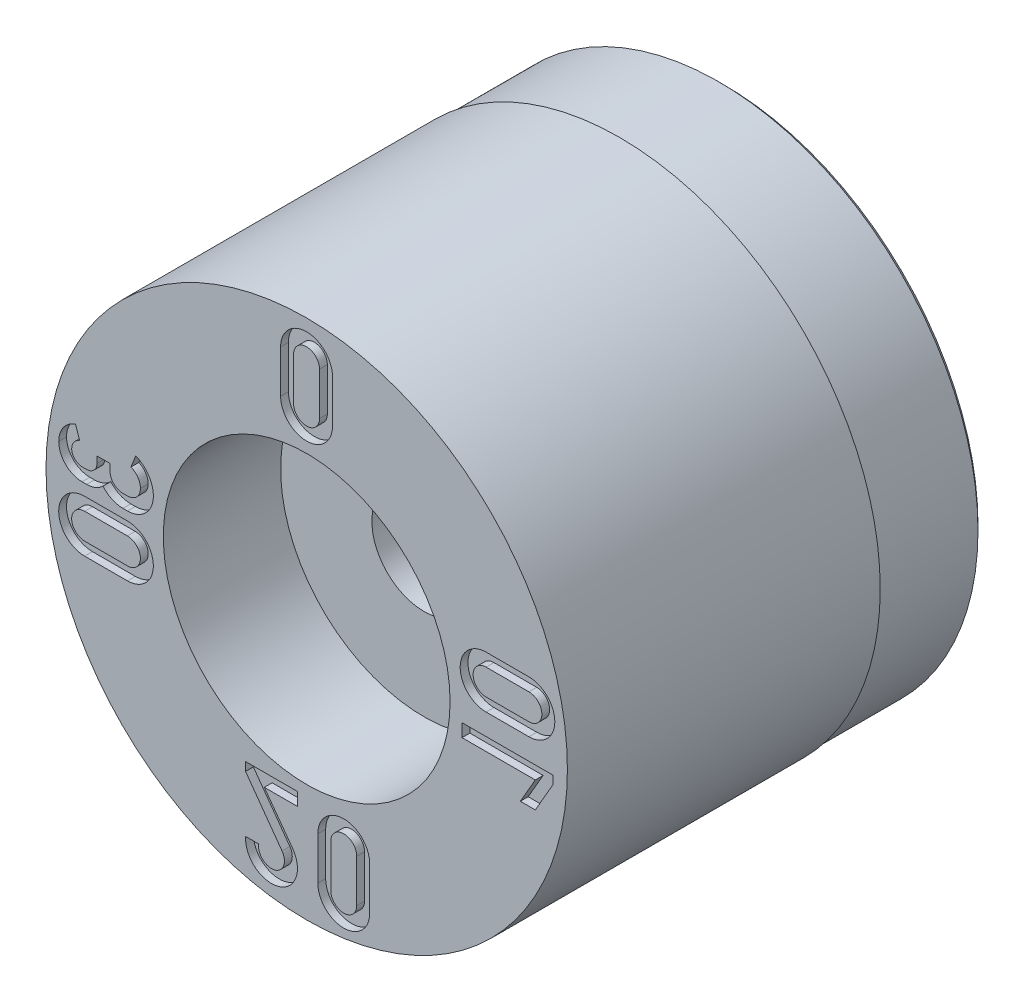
ISO-10303-21;
HEADER;
FILE_DESCRIPTION(('STEP AP214'),'2;1');
FILE_NAME('part.step','',(''),(''),'','','');
FILE_SCHEMA(('AUTOMOTIVE_DESIGN { 1 0 10303 214 1 1 1 1 }'));
ENDSEC;
DATA;
#1=APPLICATION_CONTEXT('core data for automotive mechanical design processes');
#2=APPLICATION_PROTOCOL_DEFINITION('international standard','automotive_design',2000,#1);
#3=PRODUCT_CONTEXT('',#1,'mechanical');
#4=PRODUCT('Part','Part','',(#3));
#5=PRODUCT_RELATED_PRODUCT_CATEGORY('part','',(#4));
#6=PRODUCT_DEFINITION_FORMATION('','',#4);
#7=PRODUCT_DEFINITION_CONTEXT('part definition',#1,'design');
#8=PRODUCT_DEFINITION('design','',#6,#7);
#9=PRODUCT_DEFINITION_SHAPE('','',#8);
#10=(LENGTH_UNIT() NAMED_UNIT(*) SI_UNIT(.MILLI.,.METRE.));
#11=(NAMED_UNIT(*) PLANE_ANGLE_UNIT() SI_UNIT($,.RADIAN.));
#12=(NAMED_UNIT(*) SI_UNIT($,.STERADIAN.) SOLID_ANGLE_UNIT());
#13=UNCERTAINTY_MEASURE_WITH_UNIT(LENGTH_MEASURE(1.E-05),#10,'distance_accuracy_value','');
#14=(GEOMETRIC_REPRESENTATION_CONTEXT(3) GLOBAL_UNCERTAINTY_ASSIGNED_CONTEXT((#13)) GLOBAL_UNIT_ASSIGNED_CONTEXT((#10,
#11,#12)) REPRESENTATION_CONTEXT('',''));
#15=CARTESIAN_POINT('',(0.,0.,0.));
#16=DIRECTION('',(0.,0.,1.));
#17=DIRECTION('',(1.,0.,0.));
#18=AXIS2_PLACEMENT_3D('',#15,#16,#17);
#19=CARTESIAN_POINT('',(0.,0.,3.79790950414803));
#20=DIRECTION('',(0.,0.,1.));
#21=DIRECTION('',(1.,0.,0.));
#22=AXIS2_PLACEMENT_3D('',#19,#20,#21);
#23=CYLINDRICAL_SURFACE('',#22,10.);
#24=CARTESIAN_POINT('',(0.,0.,0.));
#25=DIRECTION('',(0.,0.,1.));
#26=DIRECTION('',(1.,0.,0.));
#27=AXIS2_PLACEMENT_3D('',#24,#25,#26);
#28=CIRCLE('',#27,10.);
#29=CARTESIAN_POINT('',(10.,0.,0.));
#30=VERTEX_POINT('',#29);
#31=EDGE_CURVE('E11',#30,#30,#28,.T.);
#32=ORIENTED_EDGE('',*,*,#31,.F.);
#33=EDGE_LOOP('',(#32));
#34=FACE_BOUND('',#33,.T.);
#35=CARTESIAN_POINT('',(0.,0.,-12.));
#36=DIRECTION('',(0.,0.,-1.));
#37=DIRECTION('',(-1.,0.,0.));
#38=AXIS2_PLACEMENT_3D('',#35,#36,#37);
#39=CIRCLE('',#38,10.);
#40=CARTESIAN_POINT('',(-10.,0.,-12.));
#41=VERTEX_POINT('',#40);
#42=EDGE_CURVE('E37',#41,#41,#39,.T.);
#43=ORIENTED_EDGE('',*,*,#42,.F.);
#44=EDGE_LOOP('',(#43));
#45=FACE_BOUND('',#44,.T.);
#46=ADVANCED_FACE('F34',(#34,#45),#23,.T.);
#47=CARTESIAN_POINT('',(0.,0.,-16.));
#48=DIRECTION('',(0.,0.,1.));
#49=DIRECTION('',(1.,0.,0.));
#50=AXIS2_PLACEMENT_3D('',#47,#48,#49);
#51=CONICAL_SURFACE('',#50,9.7499999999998,0.785398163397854);
#52=CARTESIAN_POINT('',(0.,0.,-16.));
#53=DIRECTION('',(0.,0.,1.));
#54=DIRECTION('',(1.,0.,0.));
#55=AXIS2_PLACEMENT_3D('',#52,#53,#54);
#56=CIRCLE('',#55,9.7499999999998);
#57=CARTESIAN_POINT('',(9.7499999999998,0.,-16.));
#58=VERTEX_POINT('',#57);
#59=EDGE_CURVE('E1032',#58,#58,#56,.T.);
#60=ORIENTED_EDGE('',*,*,#59,.T.);
#61=EDGE_LOOP('',(#60));
#62=FACE_BOUND('',#61,.T.);
#63=CARTESIAN_POINT('',(0.,0.,-15.8149999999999));
#64=DIRECTION('',(0.,0.,1.));
#65=DIRECTION('',(1.,0.,0.));
#66=AXIS2_PLACEMENT_3D('',#63,#64,#65);
#67=CIRCLE('',#66,9.935);
#68=CARTESIAN_POINT('',(9.935,0.,-15.8149999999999));
#69=VERTEX_POINT('',#68);
#70=EDGE_CURVE('E1031',#69,#69,#67,.T.);
#71=ORIENTED_EDGE('',*,*,#70,.F.);
#72=EDGE_LOOP('',(#71));
#73=FACE_BOUND('',#72,.T.);
#74=ADVANCED_FACE('F1054',(#62,#73),#51,.T.);
#75=CARTESIAN_POINT('',(0.,10.,0.));
#76=DIRECTION('',(0.,0.,-1.));
#77=DIRECTION('',(-1.,0.,0.));
#78=AXIS2_PLACEMENT_3D('',#75,#76,#77);
#79=PLANE('',#78);
#80=DIRECTION('',(0.999999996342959,-8.55224061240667E-05,0.));
#81=VECTOR('',#80,1.);
#82=CARTESIAN_POINT('',(-6.87702715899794,-2.17040090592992,0.));
#83=LINE('',#82,#81);
#84=CARTESIAN_POINT('',(-8.51835063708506,-2.17026053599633,0.));
#85=VERTEX_POINT('',#84);
#86=CARTESIAN_POINT('',(-6.87702715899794,-2.17040090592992,0.));
#87=VERTEX_POINT('',#86);
#88=EDGE_CURVE('E522',#85,#87,#83,.T.);
#89=ORIENTED_EDGE('',*,*,#88,.F.);
#90=CARTESIAN_POINT('',(-8.51826555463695,-1.17539009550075,0.));
#91=DIRECTION('',(0.,0.,1.));
#92=DIRECTION('',(1.,0.,0.));
#93=AXIS2_PLACEMENT_3D('',#90,#91,#92);
#94=CIRCLE('',#93,0.994870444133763);
#95=CARTESIAN_POINT('',(-8.51818047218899,-0.180519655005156,0.));
#96=VERTEX_POINT('',#95);
#97=EDGE_CURVE('E50',#96,#85,#94,.T.);
#98=ORIENTED_EDGE('',*,*,#97,.F.);
#99=DIRECTION('',(-0.999999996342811,8.55241324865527E-05,0.));
#100=VECTOR('',#99,1.);
#101=CARTESIAN_POINT('',(-8.51818047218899,-0.180519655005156,0.));
#102=LINE('',#101,#100);
#103=CARTESIAN_POINT('',(-6.87690734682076,-0.18066002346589,0.));
#104=VERTEX_POINT('',#103);
#105=EDGE_CURVE('E511',#104,#96,#102,.T.);
#106=ORIENTED_EDGE('',*,*,#105,.F.);
#107=CARTESIAN_POINT('',(-6.87696221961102,-1.17553046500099,0.));
#108=DIRECTION('',(0.,0.,1.));
#109=DIRECTION('',(1.,0.,0.));
#110=AXIS2_PLACEMENT_3D('',#107,#108,#109);
#111=CIRCLE('',#110,0.994870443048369);
#112=EDGE_CURVE('E525',#87,#104,#111,.T.);
#113=ORIENTED_EDGE('',*,*,#112,.F.);
#114=EDGE_LOOP('',(#89,#98,#106,#113));
#115=FACE_BOUND('',#114,.T.);
#116=DIRECTION('',(8.43544746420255E-05,-0.999999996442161,0.));
#117=VECTOR('',#116,1.);
#118=CARTESIAN_POINT('',(-1.00078259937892,8.54476479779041,0.));
#119=LINE('',#118,#117);
#120=CARTESIAN_POINT('',(-1.00078259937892,8.54476479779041,0.));
#121=VERTEX_POINT('',#120);
#122=CARTESIAN_POINT('',(-1.00064415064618,6.90349167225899,0.));
#123=VERTEX_POINT('',#122);
#124=EDGE_CURVE('E586',#121,#123,#119,.T.);
#125=ORIENTED_EDGE('',*,*,#124,.F.);
#126=CARTESIAN_POINT('',(-0.00577290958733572,8.54484872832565,0.));
#127=DIRECTION('',(0.,0.,1.));
#128=DIRECTION('',(1.,0.,0.));
#129=AXIS2_PLACEMENT_3D('',#126,#127,#128);
#130=CIRCLE('',#129,0.995009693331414);
#131=CARTESIAN_POINT('',(0.989236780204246,8.54493265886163,0.));
#132=VERTEX_POINT('',#131);
#133=EDGE_CURVE('E564',#132,#121,#130,.T.);
#134=ORIENTED_EDGE('',*,*,#133,.F.);
#135=DIRECTION('',(8.53287261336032E-05,0.999999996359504,0.));
#136=VECTOR('',#135,1.);
#137=CARTESIAN_POINT('',(0.989096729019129,6.90361922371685,0.));
#138=LINE('',#137,#136);
#139=CARTESIAN_POINT('',(0.989096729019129,6.90361922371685,0.));
#140=VERTEX_POINT('',#139);
#141=EDGE_CURVE('E575',#140,#132,#138,.T.);
#142=ORIENTED_EDGE('',*,*,#141,.F.);
#143=CARTESIAN_POINT('',(-0.00577371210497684,6.90357559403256,0.));
#144=DIRECTION('',(0.,0.,1.));
#145=DIRECTION('',(1.,0.,0.));
#146=AXIS2_PLACEMENT_3D('',#143,#144,#145);
#147=CIRCLE('',#146,0.994870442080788);
#148=EDGE_CURVE('E589',#123,#140,#147,.T.);
#149=ORIENTED_EDGE('',*,*,#148,.F.);
#150=EDGE_LOOP('',(#125,#134,#142,#149));
#151=FACE_BOUND('',#150,.T.);
#152=DIRECTION('',(-8.43514763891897E-05,0.999999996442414,0.));
#153=VECTOR('',#152,1.);
#154=CARTESIAN_POINT('',(-0.35601353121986,-6.40350558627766,0.));
#155=LINE('',#154,#153);
#156=CARTESIAN_POINT('',(-0.35601353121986,-6.40350558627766,0.));
#157=VERTEX_POINT('',#156);
#158=CARTESIAN_POINT('',(-0.356055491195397,-5.90606348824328,0.));
#159=VERTEX_POINT('',#158);
#160=EDGE_CURVE('E633',#157,#159,#155,.T.);
#161=ORIENTED_EDGE('',*,*,#160,.F.);
#162=DIRECTION('',(0.999999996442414,8.43514759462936E-05,0.));
#163=VECTOR('',#162,1.);
#164=CARTESIAN_POINT('',(-1.62438978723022,-6.40361257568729,0.));
#165=LINE('',#164,#163);
#166=CARTESIAN_POINT('',(-1.62438978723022,-6.40361257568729,0.));
#167=VERTEX_POINT('',#166);
#168=EDGE_CURVE('E596',#167,#157,#165,.T.);
#169=ORIENTED_EDGE('',*,*,#168,.F.);
#170=DIRECTION('',(-0.589622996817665,0.80767860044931,0.));
#171=VECTOR('',#170,1.);
#172=CARTESIAN_POINT('',(-0.542537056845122,-7.88555833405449,0.));
#173=LINE('',#172,#171);
#174=CARTESIAN_POINT('',(-0.542537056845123,-7.88555833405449,0.));
#175=VERTEX_POINT('',#174);
#176=EDGE_CURVE('E607',#175,#167,#173,.T.);
#177=ORIENTED_EDGE('',*,*,#176,.F.);
#178=CARTESIAN_POINT('',(-1.35014440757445,-8.46699255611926,0.));
#179=DIRECTION('',(0.,0.,1.));
#180=DIRECTION('',(1.,0.,0.));
#181=AXIS2_PLACEMENT_3D('',#178,#179,#180);
#182=CIRCLE('',#181,0.995135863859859);
#183=CARTESIAN_POINT('',(-2.3425248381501,-8.39298939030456,0.));
#184=VERTEX_POINT('',#183);
#185=EDGE_CURVE('E651',#184,#175,#182,.T.);
#186=ORIENTED_EDGE('',*,*,#185,.F.);
#187=DIRECTION('',(-0.999999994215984,-0.000107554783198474,0.));
#188=VECTOR('',#187,1.);
#189=CARTESIAN_POINT('',(-1.84226195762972,-8.39293558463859,0.));
#190=LINE('',#189,#188);
#191=CARTESIAN_POINT('',(-1.84226195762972,-8.39293558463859,0.));
#192=VERTEX_POINT('',#191);
#193=EDGE_CURVE('E648',#192,#184,#190,.T.);
#194=ORIENTED_EDGE('',*,*,#193,.F.);
#195=CARTESIAN_POINT('',(-1.35039582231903,-8.46753855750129,0.));
#196=DIRECTION('',(0.,0.,-1.));
#197=DIRECTION('',(1.,0.,0.));
#198=AXIS2_PLACEMENT_3D('',#195,#196,#197);
#199=CIRCLE('',#198,0.497491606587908);
#200=CARTESIAN_POINT('',(-0.94674429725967,-8.17674078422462,0.));
#201=VERTEX_POINT('',#200);
#202=EDGE_CURVE('E645',#201,#192,#199,.T.);
#203=ORIENTED_EDGE('',*,*,#202,.F.);
#204=DIRECTION('',(0.584527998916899,-0.811373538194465,0.));
#205=VECTOR('',#204,1.);
#206=CARTESIAN_POINT('',(-2.34549204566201,-6.2351624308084,0.));
#207=LINE('',#206,#205);
#208=CARTESIAN_POINT('',(-2.34549204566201,-6.2351624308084,0.));
#209=VERTEX_POINT('',#208);
#210=EDGE_CURVE('E642',#209,#201,#207,.T.);
#211=ORIENTED_EDGE('',*,*,#210,.F.);
#212=DIRECTION('',(8.43514743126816E-05,-0.999999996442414,0.));
#213=VECTOR('',#212,1.);
#214=CARTESIAN_POINT('',(-2.34551979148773,-5.90623130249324,0.));
#215=LINE('',#214,#213);
#216=CARTESIAN_POINT('',(-2.34551979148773,-5.90623130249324,0.));
#217=VERTEX_POINT('',#216);
#218=EDGE_CURVE('E639',#217,#209,#215,.T.);
#219=ORIENTED_EDGE('',*,*,#218,.F.);
#220=DIRECTION('',(-0.999999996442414,-8.43514755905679E-05,0.));
#221=VECTOR('',#220,1.);
#222=CARTESIAN_POINT('',(-0.356055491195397,-5.90606348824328,0.));
#223=LINE('',#222,#221);
#224=EDGE_CURVE('E636',#159,#217,#223,.T.);
#225=ORIENTED_EDGE('',*,*,#224,.F.);
#226=EDGE_LOOP('',(#161,#169,#177,#186,#194,#203,#211,#219,#225));
#227=FACE_BOUND('',#226,.T.);
#228=DIRECTION('',(8.48997848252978E-05,-0.999999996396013,0.));
#229=VECTOR('',#228,1.);
#230=CARTESIAN_POINT('',(5.95770811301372,-0.961669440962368,0.));
#231=LINE('',#230,#229);
#232=CARTESIAN_POINT('',(5.95766589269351,-0.464373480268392,0.));
#233=VERTEX_POINT('',#232);
#234=CARTESIAN_POINT('',(5.95770811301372,-0.961669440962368,0.));
#235=VERTEX_POINT('',#234);
#236=EDGE_CURVE('E699',#233,#235,#231,.T.);
#237=ORIENTED_EDGE('',*,*,#236,.F.);
#238=DIRECTION('',(-0.999999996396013,-8.48997846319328E-05,0.));
#239=VECTOR('',#238,1.);
#240=CARTESIAN_POINT('',(5.95766589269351,-0.464373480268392,0.));
#241=LINE('',#240,#239);
#242=CARTESIAN_POINT('',(9.43915539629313,-0.464077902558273,0.));
#243=VERTEX_POINT('',#242);
#244=EDGE_CURVE('E658',#243,#233,#241,.T.);
#245=ORIENTED_EDGE('',*,*,#244,.F.);
#246=DIRECTION('',(-8.48997827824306E-05,0.999999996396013,0.));
#247=VECTOR('',#246,1.);
#248=CARTESIAN_POINT('',(9.43915539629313,-0.464077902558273,0.));
#249=LINE('',#248,#247);
#250=CARTESIAN_POINT('',(9.43918319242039,-0.791477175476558,0.));
#251=VERTEX_POINT('',#250);
#252=EDGE_CURVE('E679',#251,#243,#249,.T.);
#253=ORIENTED_EDGE('',*,*,#252,.F.);
#254=DIRECTION('',(0.498418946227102,0.866936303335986,0.));
#255=VECTOR('',#254,1.);
#256=CARTESIAN_POINT('',(9.43918319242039,-0.791477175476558,0.));
#257=LINE('',#256,#255);
#258=CARTESIAN_POINT('',(8.769582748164,-1.95616190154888,0.));
#259=VERTEX_POINT('',#258);
#260=EDGE_CURVE('E711',#259,#251,#257,.T.);
#261=ORIENTED_EDGE('',*,*,#260,.F.);
#262=DIRECTION('',(0.999999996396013,8.48997839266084E-05,0.));
#263=VECTOR('',#262,1.);
#264=CARTESIAN_POINT('',(8.769582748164,-1.95616190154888,0.));
#265=LINE('',#264,#263);
#266=CARTESIAN_POINT('',(8.19597253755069,-1.956210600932,0.));
#267=VERTEX_POINT('',#266);
#268=EDGE_CURVE('E708',#267,#259,#265,.T.);
#269=ORIENTED_EDGE('',*,*,#268,.F.);
#270=DIRECTION('',(-0.498285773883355,-0.867012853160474,0.));
#271=VECTOR('',#270,1.);
#272=CARTESIAN_POINT('',(8.19597253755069,-1.956210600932,0.));
#273=LINE('',#272,#271);
#274=CARTESIAN_POINT('',(8.76768792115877,-0.961430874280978,0.));
#275=VERTEX_POINT('',#274);
#276=EDGE_CURVE('E705',#275,#267,#273,.T.);
#277=ORIENTED_EDGE('',*,*,#276,.F.);
#278=DIRECTION('',(0.999999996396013,8.48997846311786E-05,0.));
#279=VECTOR('',#278,1.);
#280=CARTESIAN_POINT('',(8.76768792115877,-0.961430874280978,0.));
#281=LINE('',#280,#279);
#282=EDGE_CURVE('E702',#235,#275,#281,.T.);
#283=ORIENTED_EDGE('',*,*,#282,.F.);
#284=EDGE_LOOP('',(#237,#245,#253,#261,#269,#277,#283));
#285=FACE_BOUND('',#284,.T.);
#286=DIRECTION('',(-0.999999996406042,8.478158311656E-05,0.));
#287=VECTOR('',#286,1.);
#288=CARTESIAN_POINT('',(8.52233394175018,2.34056415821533,0.));
#289=LINE('',#288,#287);
#290=CARTESIAN_POINT('',(8.52233394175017,2.34056415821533,0.));
#291=VERTEX_POINT('',#290);
#292=CARTESIAN_POINT('',(6.88106079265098,2.34070330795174,0.));
#293=VERTEX_POINT('',#292);
#294=EDGE_CURVE('E779',#291,#293,#289,.T.);
#295=ORIENTED_EDGE('',*,*,#294,.F.);
#296=CARTESIAN_POINT('',(8.52241839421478,1.34583296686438,0.));
#297=DIRECTION('',(0.,0.,1.));
#298=DIRECTION('',(1.,0.,0.));
#299=AXIS2_PLACEMENT_3D('',#296,#297,#298);
#300=CIRCLE('',#299,0.994731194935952);
#301=CARTESIAN_POINT('',(8.52250284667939,0.351101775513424,0.));
#302=VERTEX_POINT('',#301);
#303=EDGE_CURVE('E757',#302,#291,#300,.T.);
#304=ORIENTED_EDGE('',*,*,#303,.F.);
#305=DIRECTION('',(0.999999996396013,8.4899785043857E-05,0.));
#306=VECTOR('',#305,1.);
#307=CARTESIAN_POINT('',(6.88118943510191,0.35096242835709,0.));
#308=LINE('',#307,#306);
#309=CARTESIAN_POINT('',(6.88118943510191,0.350962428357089,0.));
#310=VERTEX_POINT('',#309);
#311=EDGE_CURVE('E768',#310,#302,#308,.T.);
#312=ORIENTED_EDGE('',*,*,#311,.F.);
#313=CARTESIAN_POINT('',(6.88114525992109,1.34583286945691,0.));
#314=DIRECTION('',(0.,0.,1.));
#315=DIRECTION('',(1.,0.,0.));
#316=AXIS2_PLACEMENT_3D('',#313,#314,#315);
#317=CIRCLE('',#316,0.994870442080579);
#318=EDGE_CURVE('E782',#293,#310,#317,.T.);
#319=ORIENTED_EDGE('',*,*,#318,.F.);
#320=EDGE_LOOP('',(#295,#304,#312,#319));
#321=FACE_BOUND('',#320,.T.);
#322=DIRECTION('',(-0.999999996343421,8.55170029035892E-05,0.));
#323=VECTOR('',#322,1.);
#324=CARTESIAN_POINT('',(-6.87570332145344,0.64894149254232,0.));
#325=LINE('',#324,#323);
#326=CARTESIAN_POINT('',(-6.87570332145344,0.648941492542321,0.));
#327=VERTEX_POINT('',#326);
#328=CARTESIAN_POINT('',(-7.049782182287,0.648956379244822,0.));
#329=VERTEX_POINT('',#328);
#330=EDGE_CURVE('E862',#327,#329,#325,.T.);
#331=ORIENTED_EDGE('',*,*,#330,.F.);
#332=CARTESIAN_POINT('',(-6.87566078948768,1.14629249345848,0.));
#333=DIRECTION('',(0.,0.,-1.));
#334=DIRECTION('',(1.,0.,0.));
#335=AXIS2_PLACEMENT_3D('',#332,#333,#334);
#336=CIRCLE('',#335,0.497351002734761);
#337=CARTESIAN_POINT('',(-6.37830978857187,1.14624995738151,0.));
#338=VERTEX_POINT('',#337);
#339=EDGE_CURVE('E789',#338,#327,#336,.T.);
#340=ORIENTED_EDGE('',*,*,#339,.F.);
#341=CARTESIAN_POINT('',(-6.95038106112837,1.14629888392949,0.));
#342=DIRECTION('',(0.,0.,-1.));
#343=DIRECTION('',(1.,0.,0.));
#344=AXIS2_PLACEMENT_3D('',#341,#342,#343);
#345=CIRCLE('',#344,0.572071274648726);
#346=CARTESIAN_POINT('',(-6.7403665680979,1.67842617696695,0.));
#347=VERTEX_POINT('',#346);
#348=EDGE_CURVE('E800',#347,#338,#345,.T.);
#349=ORIENTED_EDGE('',*,*,#348,.F.);
#350=DIRECTION('',(-0.367087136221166,-0.930186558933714,0.));
#351=VECTOR('',#350,1.);
#352=CARTESIAN_POINT('',(-6.55783880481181,2.14094544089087,0.));
#353=LINE('',#352,#351);
#354=CARTESIAN_POINT('',(-6.55783880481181,2.14094544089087,0.));
#355=VERTEX_POINT('',#354);
#356=EDGE_CURVE('E916',#355,#347,#353,.T.);
#357=ORIENTED_EDGE('',*,*,#356,.F.);
#358=CARTESIAN_POINT('',(-6.95062486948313,1.14606525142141,0.));
#359=DIRECTION('',(0.,0.,1.));
#360=DIRECTION('',(1.,0.,0.));
#361=AXIS2_PLACEMENT_3D('',#358,#359,#360);
#362=CIRCLE('',#361,1.06961090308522);
#363=CARTESIAN_POINT('',(-5.88101396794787,1.14612283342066,0.));
#364=VERTEX_POINT('',#363);
#365=EDGE_CURVE('E913',#364,#355,#362,.T.);
#366=ORIENTED_EDGE('',*,*,#365,.F.);
#367=CARTESIAN_POINT('',(-6.87557692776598,1.14606929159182,0.));
#368=DIRECTION('',(0.,0.,1.));
#369=DIRECTION('',(1.,0.,0.));
#370=AXIS2_PLACEMENT_3D('',#367,#368,#369);
#371=CIRCLE('',#370,0.994562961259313);
#372=CARTESIAN_POINT('',(-6.87566171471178,0.151506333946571,0.));
#373=VERTEX_POINT('',#372);
#374=EDGE_CURVE('E910',#373,#364,#371,.T.);
#375=ORIENTED_EDGE('',*,*,#374,.F.);
#376=DIRECTION('',(0.99999999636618,-8.52504561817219E-05,0.));
#377=VECTOR('',#376,1.);
#378=CARTESIAN_POINT('',(-7.04980432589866,0.15152117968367,0.));
#379=LINE('',#378,#377);
#380=CARTESIAN_POINT('',(-7.04980432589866,0.15152117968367,0.));
#381=VERTEX_POINT('',#380);
#382=EDGE_CURVE('E907',#381,#373,#379,.T.);
#383=ORIENTED_EDGE('',*,*,#382,.F.);
#384=CARTESIAN_POINT('',(-7.04995877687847,1.14583457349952,0.));
#385=DIRECTION('',(0.,0.,1.));
#386=DIRECTION('',(1.,0.,0.));
#387=AXIS2_PLACEMENT_3D('',#384,#385,#386);
#388=CIRCLE('',#387,0.994313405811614);
#389=CARTESIAN_POINT('',(-7.81363116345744,0.509074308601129,0.));
#390=VERTEX_POINT('',#389);
#391=EDGE_CURVE('E904',#390,#381,#388,.T.);
#392=ORIENTED_EDGE('',*,*,#391,.F.);
#393=CARTESIAN_POINT('',(-8.44227571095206,1.14594462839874,0.));
#394=DIRECTION('',(0.,0.,1.));
#395=DIRECTION('',(1.,0.,0.));
#396=AXIS2_PLACEMENT_3D('',#393,#394,#395);
#397=CIRCLE('',#396,0.894873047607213);
#398=CARTESIAN_POINT('',(-8.44235259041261,0.251071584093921,0.));
#399=VERTEX_POINT('',#398);
#400=EDGE_CURVE('E901',#399,#390,#397,.T.);
#401=ORIENTED_EDGE('',*,*,#400,.F.);
#402=DIRECTION('',(0.999999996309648,-8.59110265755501E-05,0.));
#403=VECTOR('',#402,1.);
#404=CARTESIAN_POINT('',(-8.61635790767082,0.251086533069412,0.));
#405=LINE('',#404,#403);
#406=CARTESIAN_POINT('',(-8.61635790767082,0.251086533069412,0.));
#407=VERTEX_POINT('',#406);
#408=EDGE_CURVE('E898',#407,#399,#405,.T.);
#409=ORIENTED_EDGE('',*,*,#408,.F.);
#410=CARTESIAN_POINT('',(-8.61641961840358,1.14625809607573,0.));
#411=DIRECTION('',(0.,0.,1.));
#412=DIRECTION('',(1.,0.,0.));
#413=AXIS2_PLACEMENT_3D('',#410,#411,#412);
#414=CIRCLE('',#413,0.895171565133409);
#415=CARTESIAN_POINT('',(-9.51159114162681,1.14653201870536,0.));
#416=VERTEX_POINT('',#415);
#417=EDGE_CURVE('E895',#416,#407,#414,.T.);
#418=ORIENTED_EDGE('',*,*,#417,.F.);
#419=CARTESIAN_POINT('',(-8.56635632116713,1.14624277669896,0.));
#420=DIRECTION('',(0.,0.,1.));
#421=DIRECTION('',(1.,0.,0.));
#422=AXIS2_PLACEMENT_3D('',#419,#420,#421);
#423=CIRCLE('',#422,0.945234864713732);
#424=CARTESIAN_POINT('',(-8.86903006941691,2.04170776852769,0.));
#425=VERTEX_POINT('',#424);
#426=EDGE_CURVE('E892',#425,#416,#423,.T.);
#427=ORIENTED_EDGE('',*,*,#426,.F.);
#428=DIRECTION('',(-0.31992398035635,0.947443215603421,0.));
#429=VECTOR('',#428,1.);
#430=CARTESIAN_POINT('',(-8.70989458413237,1.57043382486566,0.));
#431=LINE('',#430,#429);
#432=CARTESIAN_POINT('',(-8.70989458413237,1.57043382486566,0.));
#433=VERTEX_POINT('',#432);
#434=EDGE_CURVE('E889',#433,#425,#431,.T.);
#435=ORIENTED_EDGE('',*,*,#434,.F.);
#436=CARTESIAN_POINT('',(-8.56719183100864,1.14679988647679,0.));
#437=DIRECTION('',(0.,0.,-1.));
#438=DIRECTION('',(1.,0.,0.));
#439=AXIS2_PLACEMENT_3D('',#436,#437,#438);
#440=CIRCLE('',#439,0.447023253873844);
#441=CARTESIAN_POINT('',(-9.01421491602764,1.1464113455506,0.));
#442=VERTEX_POINT('',#441);
#443=EDGE_CURVE('E886',#442,#433,#440,.T.);
#444=ORIENTED_EDGE('',*,*,#443,.F.);
#445=CARTESIAN_POINT('',(-8.61597911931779,1.14675748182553,0.));
#446=DIRECTION('',(0.,0.,-1.));
#447=DIRECTION('',(1.,0.,0.));
#448=AXIS2_PLACEMENT_3D('',#445,#446,#447);
#449=CIRCLE('',#448,0.398235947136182);
#450=CARTESIAN_POINT('',(-8.61636482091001,0.74852172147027,0.));
#451=VERTEX_POINT('',#450);
#452=EDGE_CURVE('E883',#451,#442,#449,.T.);
#453=ORIENTED_EDGE('',*,*,#452,.F.);
#454=DIRECTION('',(-0.999999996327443,8.57036442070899E-05,0.));
#455=VECTOR('',#454,1.);
#456=CARTESIAN_POINT('',(-8.44231004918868,0.748506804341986,0.));
#457=LINE('',#456,#455);
#458=CARTESIAN_POINT('',(-8.44231004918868,0.748506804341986,0.));
#459=VERTEX_POINT('',#458);
#460=EDGE_CURVE('E880',#459,#451,#457,.T.);
#461=ORIENTED_EDGE('',*,*,#460,.F.);
#462=CARTESIAN_POINT('',(-8.4422759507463,1.14637135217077,0.));
#463=DIRECTION('',(0.,0.,-1.));
#464=DIRECTION('',(1.,0.,0.));
#465=AXIS2_PLACEMENT_3D('',#462,#463,#464);
#466=CIRCLE('',#465,0.39786454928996);
#467=CARTESIAN_POINT('',(-8.0444114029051,1.14633739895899,0.));
#468=VERTEX_POINT('',#467);
#469=EDGE_CURVE('E877',#468,#459,#466,.T.);
#470=ORIENTED_EDGE('',*,*,#469,.F.);
#471=DIRECTION('',(-8.55211336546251E-05,-0.999999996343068,0.));
#472=VECTOR('',#471,1.);
#473=CARTESIAN_POINT('',(-8.04439014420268,1.39491574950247,0.));
#474=LINE('',#473,#472);
#475=CARTESIAN_POINT('',(-8.04439014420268,1.39491574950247,0.));
#476=VERTEX_POINT('',#475);
#477=EDGE_CURVE('E874',#476,#468,#474,.T.);
#478=ORIENTED_EDGE('',*,*,#477,.F.);
#479=DIRECTION('',(-0.999999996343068,8.55211334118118E-05,0.));
#480=VECTOR('',#479,1.);
#481=CARTESIAN_POINT('',(-7.5469549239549,1.39487320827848,0.));
#482=LINE('',#481,#480);
#483=CARTESIAN_POINT('',(-7.5469549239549,1.39487320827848,0.));
#484=VERTEX_POINT('',#483);
#485=EDGE_CURVE('E871',#484,#476,#482,.T.);
#486=ORIENTED_EDGE('',*,*,#485,.F.);
#487=DIRECTION('',(8.54959125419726E-05,0.999999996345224,0.));
#488=VECTOR('',#487,1.);
#489=CARTESIAN_POINT('',(-7.54697618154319,1.14623455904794,0.));
#490=LINE('',#489,#488);
#491=CARTESIAN_POINT('',(-7.54697618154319,1.14623455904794,0.));
#492=VERTEX_POINT('',#491);
#493=EDGE_CURVE('E868',#492,#484,#490,.T.);
#494=ORIENTED_EDGE('',*,*,#493,.F.);
#495=CARTESIAN_POINT('',(-7.04974051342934,1.14619204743,0.));
#496=DIRECTION('',(0.,0.,-1.));
#497=DIRECTION('',(1.,0.,0.));
#498=AXIS2_PLACEMENT_3D('',#495,#496,#497);
#499=CIRCLE('',#498,0.497235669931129);
#500=EDGE_CURVE('E865',#329,#492,#499,.T.);
#501=ORIENTED_EDGE('',*,*,#500,.F.);
#502=EDGE_LOOP('',(#331,#340,#349,#357,#366,#375,#383,#392,#401,#409,#418,#427,#435,#444,#453,
#461,#470,#478,#486,#494,#501));
#503=FACE_BOUND('',#502,.T.);
#504=DIRECTION('',(8.53270660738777E-05,0.999999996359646,0.));
#505=VECTOR('',#504,1.);
#506=CARTESIAN_POINT('',(2.41665684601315,-8.56159634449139,0.));
#507=LINE('',#506,#505);
#508=CARTESIAN_POINT('',(2.41665684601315,-8.56159634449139,0.));
#509=VERTEX_POINT('',#508);
#510=CARTESIAN_POINT('',(2.41679688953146,-6.9203408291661,0.));
#511=VERTEX_POINT('',#510);
#512=EDGE_CURVE('E1012',#509,#511,#507,.T.);
#513=ORIENTED_EDGE('',*,*,#512,.F.);
#514=CARTESIAN_POINT('',(1.42178640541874,-8.56168026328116,0.));
#515=DIRECTION('',(0.,0.,1.));
#516=DIRECTION('',(1.,0.,0.));
#517=AXIS2_PLACEMENT_3D('',#514,#515,#516);
#518=CIRCLE('',#517,0.994870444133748);
#519=CARTESIAN_POINT('',(0.426915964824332,-8.56176418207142,0.));
#520=VERTEX_POINT('',#519);
#521=EDGE_CURVE('E990',#520,#509,#518,.T.);
#522=ORIENTED_EDGE('',*,*,#521,.F.);
#523=DIRECTION('',(8.43514759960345E-05,-0.999999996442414,0.));
#524=VECTOR('',#523,1.);
#525=CARTESIAN_POINT('',(0.426777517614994,-6.92045077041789,0.));
#526=LINE('',#525,#524);
#527=CARTESIAN_POINT('',(0.426777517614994,-6.92045077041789,0.));
#528=VERTEX_POINT('',#527);
#529=EDGE_CURVE('E1001',#528,#520,#526,.T.);
#530=ORIENTED_EDGE('',*,*,#529,.F.);
#531=CARTESIAN_POINT('',(1.42178720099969,-6.9203492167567,0.));
#532=DIRECTION('',(0.,0.,1.));
#533=DIRECTION('',(1.,0.,0.));
#534=AXIS2_PLACEMENT_3D('',#531,#532,#533);
#535=CIRCLE('',#534,0.995009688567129);
#536=EDGE_CURVE('E1015',#511,#528,#535,.T.);
#537=ORIENTED_EDGE('',*,*,#536,.F.);
#538=EDGE_LOOP('',(#513,#522,#530,#537));
#539=FACE_BOUND('',#538,.T.);
#540=CARTESIAN_POINT('',(0.,0.,0.));
#541=DIRECTION('',(0.,0.,1.));
#542=DIRECTION('',(1.,0.,0.));
#543=AXIS2_PLACEMENT_3D('',#540,#541,#542);
#544=CIRCLE('',#543,5.5);
#545=CARTESIAN_POINT('',(5.5,0.,0.));
#546=VERTEX_POINT('',#545);
#547=EDGE_CURVE('E42',#546,#546,#544,.T.);
#548=ORIENTED_EDGE('',*,*,#547,.F.);
#549=EDGE_LOOP('',(#548));
#550=FACE_BOUND('',#549,.T.);
#551=ORIENTED_EDGE('',*,*,#31,.T.);
#552=EDGE_LOOP('',(#551));
#553=FACE_BOUND('',#552,.T.);
#554=ADVANCED_FACE('F1059',(#115,#151,#227,#285,#321,#503,#539,#550,#553),#79,.F.);
#555=CARTESIAN_POINT('',(0.,0.,3.79790950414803));
#556=DIRECTION('',(0.,0.,1.));
#557=DIRECTION('',(1.,0.,0.));
#558=AXIS2_PLACEMENT_3D('',#555,#556,#557);
#559=CYLINDRICAL_SURFACE('',#558,5.5);
#560=CARTESIAN_POINT('',(0.,0.,-4.5));
#561=DIRECTION('',(0.,0.,1.));
#562=DIRECTION('',(1.,0.,0.));
#563=AXIS2_PLACEMENT_3D('',#560,#561,#562);
#564=CIRCLE('',#563,5.5);
#565=CARTESIAN_POINT('',(5.5,0.,-4.5));
#566=VERTEX_POINT('',#565);
#567=EDGE_CURVE('E1041',#566,#566,#564,.T.);
#568=ORIENTED_EDGE('',*,*,#567,.F.);
#569=EDGE_LOOP('',(#568));
#570=FACE_BOUND('',#569,.T.);
#571=ORIENTED_EDGE('',*,*,#547,.T.);
#572=EDGE_LOOP('',(#571));
#573=FACE_BOUND('',#572,.T.);
#574=ADVANCED_FACE('F1065',(#570,#573),#559,.F.);
#575=CARTESIAN_POINT('',(0.,5.5,-4.5));
#576=DIRECTION('',(0.,0.,-1.));
#577=DIRECTION('',(-1.,0.,0.));
#578=AXIS2_PLACEMENT_3D('',#575,#576,#577);
#579=PLANE('',#578);
#580=CARTESIAN_POINT('',(0.,0.,-4.5));
#581=DIRECTION('',(0.,0.,1.));
#582=DIRECTION('',(1.,0.,0.));
#583=AXIS2_PLACEMENT_3D('',#580,#581,#582);
#584=CIRCLE('',#583,2.);
#585=CARTESIAN_POINT('',(2.,0.,-4.5));
#586=VERTEX_POINT('',#585);
#587=EDGE_CURVE('E1038',#586,#586,#584,.T.);
#588=ORIENTED_EDGE('',*,*,#587,.F.);
#589=EDGE_LOOP('',(#588));
#590=FACE_BOUND('',#589,.T.);
#591=ORIENTED_EDGE('',*,*,#567,.T.);
#592=EDGE_LOOP('',(#591));
#593=FACE_BOUND('',#592,.T.);
#594=ADVANCED_FACE('F1072',(#590,#593),#579,.F.);
#595=CARTESIAN_POINT('',(0.,0.,3.79790950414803));
#596=DIRECTION('',(0.,0.,1.));
#597=DIRECTION('',(1.,0.,0.));
#598=AXIS2_PLACEMENT_3D('',#595,#596,#597);
#599=CYLINDRICAL_SURFACE('',#598,2.);
#600=CARTESIAN_POINT('',(0.,0.,-16.));
#601=DIRECTION('',(0.,0.,1.));
#602=DIRECTION('',(1.,0.,0.));
#603=AXIS2_PLACEMENT_3D('',#600,#601,#602);
#604=CIRCLE('',#603,2.);
#605=CARTESIAN_POINT('',(2.,0.,-16.));
#606=VERTEX_POINT('',#605);
#607=EDGE_CURVE('E1035',#606,#606,#604,.T.);
#608=ORIENTED_EDGE('',*,*,#607,.F.);
#609=EDGE_LOOP('',(#608));
#610=FACE_BOUND('',#609,.T.);
#611=ORIENTED_EDGE('',*,*,#587,.T.);
#612=EDGE_LOOP('',(#611));
#613=FACE_BOUND('',#612,.T.);
#614=ADVANCED_FACE('F1223',(#610,#613),#599,.F.);
#615=CARTESIAN_POINT('',(0.,2.,-16.));
#616=DIRECTION('',(0.,0.,1.));
#617=DIRECTION('',(1.,0.,0.));
#618=AXIS2_PLACEMENT_3D('',#615,#616,#617);
#619=PLANE('',#618);
#620=ORIENTED_EDGE('',*,*,#59,.F.);
#621=EDGE_LOOP('',(#620));
#622=FACE_BOUND('',#621,.T.);
#623=ORIENTED_EDGE('',*,*,#607,.T.);
#624=EDGE_LOOP('',(#623));
#625=FACE_BOUND('',#624,.T.);
#626=ADVANCED_FACE('F1218',(#622,#625),#619,.F.);
#627=CARTESIAN_POINT('',(0.,10.935,-12.));
#628=DIRECTION('',(0.,0.,-1.));
#629=DIRECTION('',(-1.,0.,0.));
#630=AXIS2_PLACEMENT_3D('',#627,#628,#629);
#631=PLANE('',#630);
#632=CARTESIAN_POINT('',(0.,0.,-12.));
#633=DIRECTION('',(0.,0.,1.));
#634=DIRECTION('',(1.,0.,0.));
#635=AXIS2_PLACEMENT_3D('',#632,#633,#634);
#636=CIRCLE('',#635,9.935);
#637=CARTESIAN_POINT('',(9.935,0.,-12.));
#638=VERTEX_POINT('',#637);
#639=EDGE_CURVE('E1022',#638,#638,#636,.T.);
#640=ORIENTED_EDGE('',*,*,#639,.T.);
#641=EDGE_LOOP('',(#640));
#642=FACE_BOUND('',#641,.T.);
#643=ORIENTED_EDGE('',*,*,#42,.T.);
#644=EDGE_LOOP('',(#643));
#645=FACE_BOUND('',#644,.T.);
#646=ADVANCED_FACE('F1051',(#642,#645),#631,.T.);
#647=CARTESIAN_POINT('',(0.,0.,0.));
#648=DIRECTION('',(0.,0.,1.));
#649=DIRECTION('',(1.,0.,0.));
#650=AXIS2_PLACEMENT_3D('',#647,#648,#649);
#651=CYLINDRICAL_SURFACE('',#650,9.935);
#652=ORIENTED_EDGE('',*,*,#639,.F.);
#653=EDGE_LOOP('',(#652));
#654=FACE_BOUND('',#653,.T.);
#655=ORIENTED_EDGE('',*,*,#70,.T.);
#656=EDGE_LOOP('',(#655));
#657=FACE_BOUND('',#656,.T.);
#658=ADVANCED_FACE('F1213',(#654,#657),#651,.T.);
#659=CARTESIAN_POINT('',(1.42178640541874,-8.56168026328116,-0.3));
#660=DIRECTION('',(0.,0.,1.));
#661=DIRECTION('',(1.,0.,0.));
#662=AXIS2_PLACEMENT_3D('',#659,#660,#661);
#663=CYLINDRICAL_SURFACE('',#662,0.994870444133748);
#664=ORIENTED_EDGE('',*,*,#521,.T.);
#665=DIRECTION('',(0.,0.,1.));
#666=VECTOR('',#665,1.);
#667=CARTESIAN_POINT('',(2.41665684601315,-8.56159634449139,-0.3));
#668=LINE('',#667,#666);
#669=CARTESIAN_POINT('',(2.41665684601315,-8.56159634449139,-0.3));
#670=VERTEX_POINT('',#669);
#671=EDGE_CURVE('E1010',#670,#509,#668,.T.);
#672=ORIENTED_EDGE('',*,*,#671,.F.);
#673=CARTESIAN_POINT('',(1.42178640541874,-8.56168026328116,-0.3));
#674=DIRECTION('',(0.,0.,1.));
#675=DIRECTION('',(1.,0.,0.));
#676=AXIS2_PLACEMENT_3D('',#673,#674,#675);
#677=CIRCLE('',#676,0.994870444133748);
#678=CARTESIAN_POINT('',(0.426915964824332,-8.56176418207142,-0.3));
#679=VERTEX_POINT('',#678);
#680=EDGE_CURVE('E997',#679,#670,#677,.T.);
#681=ORIENTED_EDGE('',*,*,#680,.F.);
#682=DIRECTION('',(0.,0.,1.));
#683=VECTOR('',#682,1.);
#684=CARTESIAN_POINT('',(0.426915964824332,-8.56176418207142,-0.3));
#685=LINE('',#684,#683);
#686=EDGE_CURVE('E1020',#679,#520,#685,.T.);
#687=ORIENTED_EDGE('',*,*,#686,.T.);
#688=EDGE_LOOP('',(#664,#672,#681,#687));
#689=FACE_BOUND('',#688,.T.);
#690=ADVANCED_FACE('F1185',(#689),#663,.F.);
#691=CARTESIAN_POINT('',(0.426777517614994,-6.92045077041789,-0.3));
#692=DIRECTION('',(-0.999999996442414,-8.43514759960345E-05,0.));
#693=DIRECTION('',(8.43514759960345E-05,-0.999999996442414,0.));
#694=AXIS2_PLACEMENT_3D('',#691,#692,#693);
#695=PLANE('',#694);
#696=ORIENTED_EDGE('',*,*,#529,.T.);
#697=ORIENTED_EDGE('',*,*,#686,.F.);
#698=DIRECTION('',(8.43514759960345E-05,-0.999999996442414,0.));
#699=VECTOR('',#698,1.);
#700=CARTESIAN_POINT('',(0.426777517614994,-6.92045077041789,-0.3));
#701=LINE('',#700,#699);
#702=CARTESIAN_POINT('',(0.426777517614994,-6.92045077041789,-0.3));
#703=VERTEX_POINT('',#702);
#704=EDGE_CURVE('E1007',#703,#679,#701,.T.);
#705=ORIENTED_EDGE('',*,*,#704,.F.);
#706=DIRECTION('',(0.,0.,1.));
#707=VECTOR('',#706,1.);
#708=CARTESIAN_POINT('',(0.426777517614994,-6.92045077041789,-0.3));
#709=LINE('',#708,#707);
#710=EDGE_CURVE('E1023',#703,#528,#709,.T.);
#711=ORIENTED_EDGE('',*,*,#710,.T.);
#712=EDGE_LOOP('',(#696,#697,#705,#711));
#713=FACE_BOUND('',#712,.T.);
#714=ADVANCED_FACE('F1188',(#713),#695,.F.);
#715=CARTESIAN_POINT('',(1.42178720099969,-6.9203492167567,-0.3));
#716=DIRECTION('',(0.,0.,1.));
#717=DIRECTION('',(1.,0.,0.));
#718=AXIS2_PLACEMENT_3D('',#715,#716,#717);
#719=CYLINDRICAL_SURFACE('',#718,0.995009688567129);
#720=ORIENTED_EDGE('',*,*,#536,.T.);
#721=ORIENTED_EDGE('',*,*,#710,.F.);
#722=CARTESIAN_POINT('',(1.42178720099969,-6.9203492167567,-0.3));
#723=DIRECTION('',(0.,0.,1.));
#724=DIRECTION('',(1.,0.,0.));
#725=AXIS2_PLACEMENT_3D('',#722,#723,#724);
#726=CIRCLE('',#725,0.995009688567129);
#727=CARTESIAN_POINT('',(2.41679688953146,-6.9203408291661,-0.3));
#728=VERTEX_POINT('',#727);
#729=EDGE_CURVE('E1004',#728,#703,#726,.T.);
#730=ORIENTED_EDGE('',*,*,#729,.F.);
#731=DIRECTION('',(0.,0.,1.));
#732=VECTOR('',#731,1.);
#733=CARTESIAN_POINT('',(2.41679688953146,-6.9203408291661,-0.3));
#734=LINE('',#733,#732);
#735=EDGE_CURVE('E1025',#728,#511,#734,.T.);
#736=ORIENTED_EDGE('',*,*,#735,.T.);
#737=EDGE_LOOP('',(#720,#721,#730,#736));
#738=FACE_BOUND('',#737,.T.);
#739=ADVANCED_FACE('F1190',(#738),#719,.F.);
#740=CARTESIAN_POINT('',(2.41665684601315,-8.56159634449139,-0.3));
#741=DIRECTION('',(0.999999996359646,-8.53270660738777E-05,0.));
#742=DIRECTION('',(8.53270660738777E-05,0.999999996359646,0.));
#743=AXIS2_PLACEMENT_3D('',#740,#741,#742);
#744=PLANE('',#743);
#745=ORIENTED_EDGE('',*,*,#512,.T.);
#746=ORIENTED_EDGE('',*,*,#735,.F.);
#747=DIRECTION('',(8.53270660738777E-05,0.999999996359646,0.));
#748=VECTOR('',#747,1.);
#749=CARTESIAN_POINT('',(2.41665684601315,-8.56159634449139,-0.3));
#750=LINE('',#749,#748);
#751=EDGE_CURVE('E1000',#670,#728,#750,.T.);
#752=ORIENTED_EDGE('',*,*,#751,.F.);
#753=ORIENTED_EDGE('',*,*,#671,.T.);
#754=EDGE_LOOP('',(#745,#746,#752,#753));
#755=FACE_BOUND('',#754,.T.);
#756=ADVANCED_FACE('F1180',(#755),#744,.F.);
#757=CARTESIAN_POINT('',(1.42178640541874,-8.56168026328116,-0.3));
#758=DIRECTION('',(0.,0.,1.));
#759=DIRECTION('',(1.,0.,0.));
#760=AXIS2_PLACEMENT_3D('',#757,#758,#759);
#761=PLANE('',#760);
#762=DIRECTION('',(8.53190860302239E-05,0.999999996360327,0.));
#763=VECTOR('',#762,1.);
#764=CARTESIAN_POINT('',(1.91908236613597,-8.56163831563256,-0.3));
#765=LINE('',#764,#763);
#766=CARTESIAN_POINT('',(1.91908236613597,-8.56163831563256,-0.3));
#767=VERTEX_POINT('',#766);
#768=CARTESIAN_POINT('',(1.91922240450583,-6.92028963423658,-0.3));
#769=VERTEX_POINT('',#768);
#770=EDGE_CURVE('E974',#767,#769,#765,.T.);
#771=ORIENTED_EDGE('',*,*,#770,.F.);
#772=CARTESIAN_POINT('',(1.42178640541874,-8.56168026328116,-0.3));
#773=DIRECTION('',(0.,0.,1.));
#774=DIRECTION('',(1.,0.,0.));
#775=AXIS2_PLACEMENT_3D('',#772,#773,#774);
#776=CIRCLE('',#775,0.497295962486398);
#777=CARTESIAN_POINT('',(0.924490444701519,-8.56172221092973,-0.3));
#778=VERTEX_POINT('',#777);
#779=EDGE_CURVE('E971',#778,#767,#776,.T.);
#780=ORIENTED_EDGE('',*,*,#779,.F.);
#781=DIRECTION('',(8.43514751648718E-05,-0.999999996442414,0.));
#782=VECTOR('',#781,1.);
#783=CARTESIAN_POINT('',(0.924351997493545,-6.92040879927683,-0.3));
#784=LINE('',#783,#782);
#785=CARTESIAN_POINT('',(0.924351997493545,-6.92040879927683,-0.3));
#786=VERTEX_POINT('',#785);
#787=EDGE_CURVE('E967',#786,#778,#784,.T.);
#788=ORIENTED_EDGE('',*,*,#787,.F.);
#789=CARTESIAN_POINT('',(1.42178720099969,-6.9203492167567,-0.3));
#790=DIRECTION('',(0.,0.,1.));
#791=DIRECTION('',(1.,0.,0.));
#792=AXIS2_PLACEMENT_3D('',#789,#790,#791);
#793=CIRCLE('',#792,0.497435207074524);
#794=EDGE_CURVE('E964',#769,#786,#793,.T.);
#795=ORIENTED_EDGE('',*,*,#794,.F.);
#796=EDGE_LOOP('',(#771,#780,#788,#795));
#797=FACE_BOUND('',#796,.T.);
#798=ORIENTED_EDGE('',*,*,#680,.T.);
#799=ORIENTED_EDGE('',*,*,#751,.T.);
#800=ORIENTED_EDGE('',*,*,#729,.T.);
#801=ORIENTED_EDGE('',*,*,#704,.T.);
#802=EDGE_LOOP('',(#798,#799,#800,#801));
#803=FACE_BOUND('',#802,.T.);
#804=ADVANCED_FACE('F1192',(#797,#803),#761,.T.);
#805=CARTESIAN_POINT('',(1.42178720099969,-6.9203492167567,-0.3));
#806=DIRECTION('',(0.,0.,1.));
#807=DIRECTION('',(1.,0.,0.));
#808=AXIS2_PLACEMENT_3D('',#805,#806,#807);
#809=CYLINDRICAL_SURFACE('',#808,0.497435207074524);
#810=CARTESIAN_POINT('',(1.42178720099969,-6.9203492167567,0.));
#811=DIRECTION('',(0.,0.,1.));
#812=DIRECTION('',(1.,0.,0.));
#813=AXIS2_PLACEMENT_3D('',#810,#811,#812);
#814=CIRCLE('',#813,0.497435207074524);
#815=CARTESIAN_POINT('',(1.91922240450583,-6.92028963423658,0.));
#816=VERTEX_POINT('',#815);
#817=CARTESIAN_POINT('',(0.924351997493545,-6.92040879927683,0.));
#818=VERTEX_POINT('',#817);
#819=EDGE_CURVE('E923',#816,#818,#814,.T.);
#820=ORIENTED_EDGE('',*,*,#819,.F.);
#821=DIRECTION('',(0.,0.,1.));
#822=VECTOR('',#821,1.);
#823=CARTESIAN_POINT('',(1.91922240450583,-6.92028963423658,-0.3));
#824=LINE('',#823,#822);
#825=EDGE_CURVE('E988',#769,#816,#824,.T.);
#826=ORIENTED_EDGE('',*,*,#825,.F.);
#827=ORIENTED_EDGE('',*,*,#794,.T.);
#828=DIRECTION('',(0.,0.,1.));
#829=VECTOR('',#828,1.);
#830=CARTESIAN_POINT('',(0.924351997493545,-6.92040879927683,-0.3));
#831=LINE('',#830,#829);
#832=EDGE_CURVE('E977',#786,#818,#831,.T.);
#833=ORIENTED_EDGE('',*,*,#832,.T.);
#834=EDGE_LOOP('',(#820,#826,#827,#833));
#835=FACE_BOUND('',#834,.T.);
#836=ADVANCED_FACE('F1194',(#835),#809,.T.);
#837=CARTESIAN_POINT('',(1.91908236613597,-8.56163831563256,-0.3));
#838=DIRECTION('',(0.999999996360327,-8.53190860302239E-05,0.));
#839=DIRECTION('',(8.53190860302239E-05,0.999999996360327,0.));
#840=AXIS2_PLACEMENT_3D('',#837,#838,#839);
#841=PLANE('',#840);
#842=DIRECTION('',(8.53190860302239E-05,0.999999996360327,0.));
#843=VECTOR('',#842,1.);
#844=CARTESIAN_POINT('',(1.91908236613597,-8.56163831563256,0.));
#845=LINE('',#844,#843);
#846=CARTESIAN_POINT('',(1.91908236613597,-8.56163831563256,0.));
#847=VERTEX_POINT('',#846);
#848=EDGE_CURVE('E968',#847,#816,#845,.T.);
#849=ORIENTED_EDGE('',*,*,#848,.F.);
#850=DIRECTION('',(0.,0.,1.));
#851=VECTOR('',#850,1.);
#852=CARTESIAN_POINT('',(1.91908236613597,-8.56163831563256,-0.3));
#853=LINE('',#852,#851);
#854=EDGE_CURVE('E991',#767,#847,#853,.T.);
#855=ORIENTED_EDGE('',*,*,#854,.F.);
#856=ORIENTED_EDGE('',*,*,#770,.T.);
#857=ORIENTED_EDGE('',*,*,#825,.T.);
#858=EDGE_LOOP('',(#849,#855,#856,#857));
#859=FACE_BOUND('',#858,.T.);
#860=ADVANCED_FACE('F1201',(#859),#841,.T.);
#861=CARTESIAN_POINT('',(1.42178640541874,-8.56168026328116,-0.3));
#862=DIRECTION('',(0.,0.,1.));
#863=DIRECTION('',(1.,0.,0.));
#864=AXIS2_PLACEMENT_3D('',#861,#862,#863);
#865=CYLINDRICAL_SURFACE('',#864,0.497295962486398);
#866=CARTESIAN_POINT('',(1.42178640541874,-8.56168026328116,0.));
#867=DIRECTION('',(0.,0.,1.));
#868=DIRECTION('',(1.,0.,0.));
#869=AXIS2_PLACEMENT_3D('',#866,#867,#868);
#870=CIRCLE('',#869,0.497295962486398);
#871=CARTESIAN_POINT('',(0.924490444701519,-8.56172221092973,0.));
#872=VERTEX_POINT('',#871);
#873=EDGE_CURVE('E983',#872,#847,#870,.T.);
#874=ORIENTED_EDGE('',*,*,#873,.F.);
#875=DIRECTION('',(0.,0.,1.));
#876=VECTOR('',#875,1.);
#877=CARTESIAN_POINT('',(0.924490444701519,-8.56172221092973,-0.3));
#878=LINE('',#877,#876);
#879=EDGE_CURVE('E993',#778,#872,#878,.T.);
#880=ORIENTED_EDGE('',*,*,#879,.F.);
#881=ORIENTED_EDGE('',*,*,#779,.T.);
#882=ORIENTED_EDGE('',*,*,#854,.T.);
#883=EDGE_LOOP('',(#874,#880,#881,#882));
#884=FACE_BOUND('',#883,.T.);
#885=ADVANCED_FACE('F1092',(#884),#865,.T.);
#886=CARTESIAN_POINT('',(0.924351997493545,-6.92040879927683,-0.3));
#887=DIRECTION('',(-0.999999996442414,-8.43514751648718E-05,0.));
#888=DIRECTION('',(8.43514751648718E-05,-0.999999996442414,0.));
#889=AXIS2_PLACEMENT_3D('',#886,#887,#888);
#890=PLANE('',#889);
#891=DIRECTION('',(8.43514751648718E-05,-0.999999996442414,0.));
#892=VECTOR('',#891,1.);
#893=CARTESIAN_POINT('',(0.924351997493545,-6.92040879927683,0.));
#894=LINE('',#893,#892);
#895=EDGE_CURVE('E980',#818,#872,#894,.T.);
#896=ORIENTED_EDGE('',*,*,#895,.F.);
#897=ORIENTED_EDGE('',*,*,#832,.F.);
#898=ORIENTED_EDGE('',*,*,#787,.T.);
#899=ORIENTED_EDGE('',*,*,#879,.T.);
#900=EDGE_LOOP('',(#896,#897,#898,#899));
#901=FACE_BOUND('',#900,.T.);
#902=ADVANCED_FACE('F1082',(#901),#890,.T.);
#903=ORIENTED_EDGE('',*,*,#819,.T.);
#904=ORIENTED_EDGE('',*,*,#895,.T.);
#905=ORIENTED_EDGE('',*,*,#873,.T.);
#906=ORIENTED_EDGE('',*,*,#848,.T.);
#907=EDGE_LOOP('',(#903,#904,#905,#906));
#908=FACE_BOUND('',#907,.T.);
#909=ADVANCED_FACE('F1068',(#908),#79,.F.);
#910=CARTESIAN_POINT('',(-6.87566078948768,1.14629249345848,-0.3));
#911=DIRECTION('',(0.,0.,1.));
#912=DIRECTION('',(1.,0.,0.));
#913=AXIS2_PLACEMENT_3D('',#910,#911,#912);
#914=CYLINDRICAL_SURFACE('',#913,0.497351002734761);
#915=ORIENTED_EDGE('',*,*,#339,.T.);
#916=DIRECTION('',(0.,0.,1.));
#917=VECTOR('',#916,1.);
#918=CARTESIAN_POINT('',(-6.87570332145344,0.64894149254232,-0.3));
#919=LINE('',#918,#917);
#920=CARTESIAN_POINT('',(-6.87570332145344,0.64894149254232,-0.3));
#921=VERTEX_POINT('',#920);
#922=EDGE_CURVE('E860',#921,#327,#919,.T.);
#923=ORIENTED_EDGE('',*,*,#922,.F.);
#924=CARTESIAN_POINT('',(-6.87566078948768,1.14629249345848,-0.3));
#925=DIRECTION('',(0.,0.,-1.));
#926=DIRECTION('',(1.,0.,0.));
#927=AXIS2_PLACEMENT_3D('',#924,#925,#926);
#928=CIRCLE('',#927,0.497351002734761);
#929=CARTESIAN_POINT('',(-6.37830978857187,1.14624995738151,-0.3));
#930=VERTEX_POINT('',#929);
#931=EDGE_CURVE('E796',#930,#921,#928,.T.);
#932=ORIENTED_EDGE('',*,*,#931,.F.);
#933=DIRECTION('',(0.,0.,1.));
#934=VECTOR('',#933,1.);
#935=CARTESIAN_POINT('',(-6.37830978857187,1.14624995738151,-0.3));
#936=LINE('',#935,#934);
#937=EDGE_CURVE('E921',#930,#338,#936,.T.);
#938=ORIENTED_EDGE('',*,*,#937,.T.);
#939=EDGE_LOOP('',(#915,#923,#932,#938));
#940=FACE_BOUND('',#939,.T.);
#941=ADVANCED_FACE('F1081',(#940),#914,.T.);
#942=CARTESIAN_POINT('',(-6.95038106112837,1.14629888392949,-0.3));
#943=DIRECTION('',(0.,0.,1.));
#944=DIRECTION('',(1.,0.,0.));
#945=AXIS2_PLACEMENT_3D('',#942,#943,#944);
#946=CYLINDRICAL_SURFACE('',#945,0.572071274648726);
#947=ORIENTED_EDGE('',*,*,#348,.T.);
#948=ORIENTED_EDGE('',*,*,#937,.F.);
#949=CARTESIAN_POINT('',(-6.95038106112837,1.14629888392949,-0.3));
#950=DIRECTION('',(0.,0.,-1.));
#951=DIRECTION('',(1.,0.,0.));
#952=AXIS2_PLACEMENT_3D('',#949,#950,#951);
#953=CIRCLE('',#952,0.572071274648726);
#954=CARTESIAN_POINT('',(-6.7403665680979,1.67842617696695,-0.3));
#955=VERTEX_POINT('',#954);
#956=EDGE_CURVE('E857',#955,#930,#953,.T.);
#957=ORIENTED_EDGE('',*,*,#956,.F.);
#958=DIRECTION('',(0.,0.,1.));
#959=VECTOR('',#958,1.);
#960=CARTESIAN_POINT('',(-6.7403665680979,1.67842617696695,-0.3));
#961=LINE('',#960,#959);
#962=EDGE_CURVE('E924',#955,#347,#961,.T.);
#963=ORIENTED_EDGE('',*,*,#962,.T.);
#964=EDGE_LOOP('',(#947,#948,#957,#963));
#965=FACE_BOUND('',#964,.T.);
#966=ADVANCED_FACE('F1089',(#965),#946,.T.);
#967=CARTESIAN_POINT('',(-6.55783880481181,2.14094544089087,-0.3));
#968=DIRECTION('',(-0.930186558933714,0.367087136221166,0.));
#969=DIRECTION('',(-0.367087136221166,-0.930186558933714,0.));
#970=AXIS2_PLACEMENT_3D('',#967,#968,#969);
#971=PLANE('',#970);
#972=ORIENTED_EDGE('',*,*,#356,.T.);
#973=ORIENTED_EDGE('',*,*,#962,.F.);
#974=DIRECTION('',(-0.367087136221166,-0.930186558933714,0.));
#975=VECTOR('',#974,1.);
#976=CARTESIAN_POINT('',(-6.55783880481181,2.14094544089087,-0.3));
#977=LINE('',#976,#975);
#978=CARTESIAN_POINT('',(-6.55783880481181,2.14094544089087,-0.3));
#979=VERTEX_POINT('',#978);
#980=EDGE_CURVE('E854',#979,#955,#977,.T.);
#981=ORIENTED_EDGE('',*,*,#980,.F.);
#982=DIRECTION('',(0.,0.,1.));
#983=VECTOR('',#982,1.);
#984=CARTESIAN_POINT('',(-6.55783880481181,2.14094544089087,-0.3));
#985=LINE('',#984,#983);
#986=EDGE_CURVE('E926',#979,#355,#985,.T.);
#987=ORIENTED_EDGE('',*,*,#986,.T.);
#988=EDGE_LOOP('',(#972,#973,#981,#987));
#989=FACE_BOUND('',#988,.T.);
#990=ADVANCED_FACE('F1325',(#989),#971,.F.);
#991=CARTESIAN_POINT('',(-6.95062486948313,1.14606525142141,-0.3));
#992=DIRECTION('',(0.,0.,1.));
#993=DIRECTION('',(1.,0.,0.));
#994=AXIS2_PLACEMENT_3D('',#991,#992,#993);
#995=CYLINDRICAL_SURFACE('',#994,1.06961090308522);
#996=ORIENTED_EDGE('',*,*,#365,.T.);
#997=ORIENTED_EDGE('',*,*,#986,.F.);
#998=CARTESIAN_POINT('',(-6.95062486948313,1.14606525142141,-0.3));
#999=DIRECTION('',(0.,0.,1.));
#1000=DIRECTION('',(1.,0.,0.));
#1001=AXIS2_PLACEMENT_3D('',#998,#999,#1000);
#1002=CIRCLE('',#1001,1.06961090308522);
#1003=CARTESIAN_POINT('',(-5.88101396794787,1.14612283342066,-0.3));
#1004=VERTEX_POINT('',#1003);
#1005=EDGE_CURVE('E851',#1004,#979,#1002,.T.);
#1006=ORIENTED_EDGE('',*,*,#1005,.F.);
#1007=DIRECTION('',(0.,0.,1.));
#1008=VECTOR('',#1007,1.);
#1009=CARTESIAN_POINT('',(-5.88101396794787,1.14612283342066,-0.3));
#1010=LINE('',#1009,#1008);
#1011=EDGE_CURVE('E928',#1004,#364,#1010,.T.);
#1012=ORIENTED_EDGE('',*,*,#1011,.T.);
#1013=EDGE_LOOP('',(#996,#997,#1006,#1012));
#1014=FACE_BOUND('',#1013,.T.);
#1015=ADVANCED_FACE('F1335',(#1014),#995,.F.);
#1016=CARTESIAN_POINT('',(-6.87557692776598,1.14606929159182,-0.3));
#1017=DIRECTION('',(0.,0.,1.));
#1018=DIRECTION('',(1.,0.,0.));
#1019=AXIS2_PLACEMENT_3D('',#1016,#1017,#1018);
#1020=CYLINDRICAL_SURFACE('',#1019,0.994562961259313);
#1021=ORIENTED_EDGE('',*,*,#374,.T.);
#1022=ORIENTED_EDGE('',*,*,#1011,.F.);
#1023=CARTESIAN_POINT('',(-6.87557692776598,1.14606929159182,-0.3));
#1024=DIRECTION('',(0.,0.,1.));
#1025=DIRECTION('',(1.,0.,0.));
#1026=AXIS2_PLACEMENT_3D('',#1023,#1024,#1025);
#1027=CIRCLE('',#1026,0.994562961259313);
#1028=CARTESIAN_POINT('',(-6.87566171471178,0.151506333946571,-0.3));
#1029=VERTEX_POINT('',#1028);
#1030=EDGE_CURVE('E848',#1029,#1004,#1027,.T.);
#1031=ORIENTED_EDGE('',*,*,#1030,.F.);
#1032=DIRECTION('',(0.,0.,1.));
#1033=VECTOR('',#1032,1.);
#1034=CARTESIAN_POINT('',(-6.87566171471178,0.151506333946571,-0.3));
#1035=LINE('',#1034,#1033);
#1036=EDGE_CURVE('E930',#1029,#373,#1035,.T.);
#1037=ORIENTED_EDGE('',*,*,#1036,.T.);
#1038=EDGE_LOOP('',(#1021,#1022,#1031,#1037));
#1039=FACE_BOUND('',#1038,.T.);
#1040=ADVANCED_FACE('F1345',(#1039),#1020,.F.);
#1041=CARTESIAN_POINT('',(-7.04980432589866,0.15152117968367,-0.3));
#1042=DIRECTION('',(-8.52504561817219E-05,-0.99999999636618,0.));
#1043=DIRECTION('',(0.99999999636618,-8.52504561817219E-05,0.));
#1044=AXIS2_PLACEMENT_3D('',#1041,#1042,#1043);
#1045=PLANE('',#1044);
#1046=ORIENTED_EDGE('',*,*,#382,.T.);
#1047=ORIENTED_EDGE('',*,*,#1036,.F.);
#1048=DIRECTION('',(0.99999999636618,-8.52504561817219E-05,0.));
#1049=VECTOR('',#1048,1.);
#1050=CARTESIAN_POINT('',(-7.04980432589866,0.15152117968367,-0.3));
#1051=LINE('',#1050,#1049);
#1052=CARTESIAN_POINT('',(-7.04980432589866,0.15152117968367,-0.3));
#1053=VERTEX_POINT('',#1052);
#1054=EDGE_CURVE('E845',#1053,#1029,#1051,.T.);
#1055=ORIENTED_EDGE('',*,*,#1054,.F.);
#1056=DIRECTION('',(0.,0.,1.));
#1057=VECTOR('',#1056,1.);
#1058=CARTESIAN_POINT('',(-7.04980432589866,0.15152117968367,-0.3));
#1059=LINE('',#1058,#1057);
#1060=EDGE_CURVE('E932',#1053,#381,#1059,.T.);
#1061=ORIENTED_EDGE('',*,*,#1060,.T.);
#1062=EDGE_LOOP('',(#1046,#1047,#1055,#1061));
#1063=FACE_BOUND('',#1062,.T.);
#1064=ADVANCED_FACE('F1355',(#1063),#1045,.F.);
#1065=CARTESIAN_POINT('',(-7.04995877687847,1.14583457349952,-0.3));
#1066=DIRECTION('',(0.,0.,1.));
#1067=DIRECTION('',(1.,0.,0.));
#1068=AXIS2_PLACEMENT_3D('',#1065,#1066,#1067);
#1069=CYLINDRICAL_SURFACE('',#1068,0.994313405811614);
#1070=ORIENTED_EDGE('',*,*,#391,.T.);
#1071=ORIENTED_EDGE('',*,*,#1060,.F.);
#1072=CARTESIAN_POINT('',(-7.04995877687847,1.14583457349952,-0.3));
#1073=DIRECTION('',(0.,0.,1.));
#1074=DIRECTION('',(1.,0.,0.));
#1075=AXIS2_PLACEMENT_3D('',#1072,#1073,#1074);
#1076=CIRCLE('',#1075,0.994313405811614);
#1077=CARTESIAN_POINT('',(-7.81363116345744,0.509074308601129,-0.3));
#1078=VERTEX_POINT('',#1077);
#1079=EDGE_CURVE('E842',#1078,#1053,#1076,.T.);
#1080=ORIENTED_EDGE('',*,*,#1079,.F.);
#1081=DIRECTION('',(0.,0.,1.));
#1082=VECTOR('',#1081,1.);
#1083=CARTESIAN_POINT('',(-7.81363116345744,0.509074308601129,-0.3));
#1084=LINE('',#1083,#1082);
#1085=EDGE_CURVE('E934',#1078,#390,#1084,.T.);
#1086=ORIENTED_EDGE('',*,*,#1085,.T.);
#1087=EDGE_LOOP('',(#1070,#1071,#1080,#1086));
#1088=FACE_BOUND('',#1087,.T.);
#1089=ADVANCED_FACE('F1365',(#1088),#1069,.F.);
#1090=CARTESIAN_POINT('',(-8.44227571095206,1.14594462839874,-0.3));
#1091=DIRECTION('',(0.,0.,1.));
#1092=DIRECTION('',(1.,0.,0.));
#1093=AXIS2_PLACEMENT_3D('',#1090,#1091,#1092);
#1094=CYLINDRICAL_SURFACE('',#1093,0.894873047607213);
#1095=ORIENTED_EDGE('',*,*,#400,.T.);
#1096=ORIENTED_EDGE('',*,*,#1085,.F.);
#1097=CARTESIAN_POINT('',(-8.44227571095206,1.14594462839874,-0.3));
#1098=DIRECTION('',(0.,0.,1.));
#1099=DIRECTION('',(1.,0.,0.));
#1100=AXIS2_PLACEMENT_3D('',#1097,#1098,#1099);
#1101=CIRCLE('',#1100,0.894873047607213);
#1102=CARTESIAN_POINT('',(-8.44235259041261,0.251071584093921,-0.3));
#1103=VERTEX_POINT('',#1102);
#1104=EDGE_CURVE('E839',#1103,#1078,#1101,.T.);
#1105=ORIENTED_EDGE('',*,*,#1104,.F.);
#1106=DIRECTION('',(0.,0.,1.));
#1107=VECTOR('',#1106,1.);
#1108=CARTESIAN_POINT('',(-8.44235259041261,0.251071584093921,-0.3));
#1109=LINE('',#1108,#1107);
#1110=EDGE_CURVE('E936',#1103,#399,#1109,.T.);
#1111=ORIENTED_EDGE('',*,*,#1110,.T.);
#1112=EDGE_LOOP('',(#1095,#1096,#1105,#1111));
#1113=FACE_BOUND('',#1112,.T.);
#1114=ADVANCED_FACE('F1375',(#1113),#1094,.F.);
#1115=CARTESIAN_POINT('',(-8.61635790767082,0.251086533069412,-0.3));
#1116=DIRECTION('',(-8.59110265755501E-05,-0.999999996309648,0.));
#1117=DIRECTION('',(0.999999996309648,-8.59110265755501E-05,0.));
#1118=AXIS2_PLACEMENT_3D('',#1115,#1116,#1117);
#1119=PLANE('',#1118);
#1120=ORIENTED_EDGE('',*,*,#408,.T.);
#1121=ORIENTED_EDGE('',*,*,#1110,.F.);
#1122=DIRECTION('',(0.999999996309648,-8.59110265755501E-05,0.));
#1123=VECTOR('',#1122,1.);
#1124=CARTESIAN_POINT('',(-8.61635790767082,0.251086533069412,-0.3));
#1125=LINE('',#1124,#1123);
#1126=CARTESIAN_POINT('',(-8.61635790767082,0.251086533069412,-0.3));
#1127=VERTEX_POINT('',#1126);
#1128=EDGE_CURVE('E836',#1127,#1103,#1125,.T.);
#1129=ORIENTED_EDGE('',*,*,#1128,.F.);
#1130=DIRECTION('',(0.,0.,1.));
#1131=VECTOR('',#1130,1.);
#1132=CARTESIAN_POINT('',(-8.61635790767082,0.251086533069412,-0.3));
#1133=LINE('',#1132,#1131);
#1134=EDGE_CURVE('E938',#1127,#407,#1133,.T.);
#1135=ORIENTED_EDGE('',*,*,#1134,.T.);
#1136=EDGE_LOOP('',(#1120,#1121,#1129,#1135));
#1137=FACE_BOUND('',#1136,.T.);
#1138=ADVANCED_FACE('F1385',(#1137),#1119,.F.);
#1139=CARTESIAN_POINT('',(-8.61641961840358,1.14625809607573,-0.3));
#1140=DIRECTION('',(0.,0.,1.));
#1141=DIRECTION('',(1.,0.,0.));
#1142=AXIS2_PLACEMENT_3D('',#1139,#1140,#1141);
#1143=CYLINDRICAL_SURFACE('',#1142,0.895171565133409);
#1144=ORIENTED_EDGE('',*,*,#417,.T.);
#1145=ORIENTED_EDGE('',*,*,#1134,.F.);
#1146=CARTESIAN_POINT('',(-8.61641961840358,1.14625809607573,-0.3));
#1147=DIRECTION('',(0.,0.,1.));
#1148=DIRECTION('',(1.,0.,0.));
#1149=AXIS2_PLACEMENT_3D('',#1146,#1147,#1148);
#1150=CIRCLE('',#1149,0.895171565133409);
#1151=CARTESIAN_POINT('',(-9.51159114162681,1.14653201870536,-0.3));
#1152=VERTEX_POINT('',#1151);
#1153=EDGE_CURVE('E833',#1152,#1127,#1150,.T.);
#1154=ORIENTED_EDGE('',*,*,#1153,.F.);
#1155=DIRECTION('',(0.,0.,1.));
#1156=VECTOR('',#1155,1.);
#1157=CARTESIAN_POINT('',(-9.51159114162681,1.14653201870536,-0.3));
#1158=LINE('',#1157,#1156);
#1159=EDGE_CURVE('E940',#1152,#416,#1158,.T.);
#1160=ORIENTED_EDGE('',*,*,#1159,.T.);
#1161=EDGE_LOOP('',(#1144,#1145,#1154,#1160));
#1162=FACE_BOUND('',#1161,.T.);
#1163=ADVANCED_FACE('F1395',(#1162),#1143,.F.);
#1164=CARTESIAN_POINT('',(-8.56635632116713,1.14624277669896,-0.3));
#1165=DIRECTION('',(0.,0.,1.));
#1166=DIRECTION('',(1.,0.,0.));
#1167=AXIS2_PLACEMENT_3D('',#1164,#1165,#1166);
#1168=CYLINDRICAL_SURFACE('',#1167,0.945234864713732);
#1169=ORIENTED_EDGE('',*,*,#426,.T.);
#1170=ORIENTED_EDGE('',*,*,#1159,.F.);
#1171=CARTESIAN_POINT('',(-8.56635632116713,1.14624277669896,-0.3));
#1172=DIRECTION('',(0.,0.,1.));
#1173=DIRECTION('',(1.,0.,0.));
#1174=AXIS2_PLACEMENT_3D('',#1171,#1172,#1173);
#1175=CIRCLE('',#1174,0.945234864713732);
#1176=CARTESIAN_POINT('',(-8.86903006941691,2.04170776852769,-0.3));
#1177=VERTEX_POINT('',#1176);
#1178=EDGE_CURVE('E830',#1177,#1152,#1175,.T.);
#1179=ORIENTED_EDGE('',*,*,#1178,.F.);
#1180=DIRECTION('',(0.,0.,1.));
#1181=VECTOR('',#1180,1.);
#1182=CARTESIAN_POINT('',(-8.86903006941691,2.04170776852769,-0.3));
#1183=LINE('',#1182,#1181);
#1184=EDGE_CURVE('E942',#1177,#425,#1183,.T.);
#1185=ORIENTED_EDGE('',*,*,#1184,.T.);
#1186=EDGE_LOOP('',(#1169,#1170,#1179,#1185));
#1187=FACE_BOUND('',#1186,.T.);
#1188=ADVANCED_FACE('F1405',(#1187),#1168,.F.);
#1189=CARTESIAN_POINT('',(-8.70989458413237,1.57043382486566,-0.3));
#1190=DIRECTION('',(0.94744321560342,0.31992398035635,0.));
#1191=DIRECTION('',(-0.31992398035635,0.947443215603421,0.));
#1192=AXIS2_PLACEMENT_3D('',#1189,#1190,#1191);
#1193=PLANE('',#1192);
#1194=ORIENTED_EDGE('',*,*,#434,.T.);
#1195=ORIENTED_EDGE('',*,*,#1184,.F.);
#1196=DIRECTION('',(-0.31992398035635,0.947443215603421,0.));
#1197=VECTOR('',#1196,1.);
#1198=CARTESIAN_POINT('',(-8.70989458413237,1.57043382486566,-0.3));
#1199=LINE('',#1198,#1197);
#1200=CARTESIAN_POINT('',(-8.70989458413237,1.57043382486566,-0.3));
#1201=VERTEX_POINT('',#1200);
#1202=EDGE_CURVE('E827',#1201,#1177,#1199,.T.);
#1203=ORIENTED_EDGE('',*,*,#1202,.F.);
#1204=DIRECTION('',(0.,0.,1.));
#1205=VECTOR('',#1204,1.);
#1206=CARTESIAN_POINT('',(-8.70989458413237,1.57043382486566,-0.3));
#1207=LINE('',#1206,#1205);
#1208=EDGE_CURVE('E944',#1201,#433,#1207,.T.);
#1209=ORIENTED_EDGE('',*,*,#1208,.T.);
#1210=EDGE_LOOP('',(#1194,#1195,#1203,#1209));
#1211=FACE_BOUND('',#1210,.T.);
#1212=ADVANCED_FACE('F1415',(#1211),#1193,.F.);
#1213=CARTESIAN_POINT('',(-8.56719183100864,1.14679988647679,-0.3));
#1214=DIRECTION('',(0.,0.,1.));
#1215=DIRECTION('',(1.,0.,0.));
#1216=AXIS2_PLACEMENT_3D('',#1213,#1214,#1215);
#1217=CYLINDRICAL_SURFACE('',#1216,0.447023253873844);
#1218=ORIENTED_EDGE('',*,*,#443,.T.);
#1219=ORIENTED_EDGE('',*,*,#1208,.F.);
#1220=CARTESIAN_POINT('',(-8.56719183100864,1.14679988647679,-0.3));
#1221=DIRECTION('',(0.,0.,-1.));
#1222=DIRECTION('',(1.,0.,0.));
#1223=AXIS2_PLACEMENT_3D('',#1220,#1221,#1222);
#1224=CIRCLE('',#1223,0.447023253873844);
#1225=CARTESIAN_POINT('',(-9.01421491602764,1.1464113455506,-0.3));
#1226=VERTEX_POINT('',#1225);
#1227=EDGE_CURVE('E824',#1226,#1201,#1224,.T.);
#1228=ORIENTED_EDGE('',*,*,#1227,.F.);
#1229=DIRECTION('',(0.,0.,1.));
#1230=VECTOR('',#1229,1.);
#1231=CARTESIAN_POINT('',(-9.01421491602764,1.1464113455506,-0.3));
#1232=LINE('',#1231,#1230);
#1233=EDGE_CURVE('E946',#1226,#442,#1232,.T.);
#1234=ORIENTED_EDGE('',*,*,#1233,.T.);
#1235=EDGE_LOOP('',(#1218,#1219,#1228,#1234));
#1236=FACE_BOUND('',#1235,.T.);
#1237=ADVANCED_FACE('F1425',(#1236),#1217,.T.);
#1238=CARTESIAN_POINT('',(-8.61597911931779,1.14675748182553,-0.3));
#1239=DIRECTION('',(0.,0.,1.));
#1240=DIRECTION('',(1.,0.,0.));
#1241=AXIS2_PLACEMENT_3D('',#1238,#1239,#1240);
#1242=CYLINDRICAL_SURFACE('',#1241,0.398235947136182);
#1243=ORIENTED_EDGE('',*,*,#452,.T.);
#1244=ORIENTED_EDGE('',*,*,#1233,.F.);
#1245=CARTESIAN_POINT('',(-8.61597911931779,1.14675748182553,-0.3));
#1246=DIRECTION('',(0.,0.,-1.));
#1247=DIRECTION('',(1.,0.,0.));
#1248=AXIS2_PLACEMENT_3D('',#1245,#1246,#1247);
#1249=CIRCLE('',#1248,0.398235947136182);
#1250=CARTESIAN_POINT('',(-8.61636482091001,0.74852172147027,-0.3));
#1251=VERTEX_POINT('',#1250);
#1252=EDGE_CURVE('E821',#1251,#1226,#1249,.T.);
#1253=ORIENTED_EDGE('',*,*,#1252,.F.);
#1254=DIRECTION('',(0.,0.,1.));
#1255=VECTOR('',#1254,1.);
#1256=CARTESIAN_POINT('',(-8.61636482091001,0.74852172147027,-0.3));
#1257=LINE('',#1256,#1255);
#1258=EDGE_CURVE('E948',#1251,#451,#1257,.T.);
#1259=ORIENTED_EDGE('',*,*,#1258,.T.);
#1260=EDGE_LOOP('',(#1243,#1244,#1253,#1259));
#1261=FACE_BOUND('',#1260,.T.);
#1262=ADVANCED_FACE('F1435',(#1261),#1242,.T.);
#1263=CARTESIAN_POINT('',(-8.44231004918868,0.748506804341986,-0.3));
#1264=DIRECTION('',(8.57036442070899E-05,0.999999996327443,0.));
#1265=DIRECTION('',(-0.999999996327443,8.57036442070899E-05,0.));
#1266=AXIS2_PLACEMENT_3D('',#1263,#1264,#1265);
#1267=PLANE('',#1266);
#1268=ORIENTED_EDGE('',*,*,#460,.T.);
#1269=ORIENTED_EDGE('',*,*,#1258,.F.);
#1270=DIRECTION('',(-0.999999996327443,8.57036442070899E-05,0.));
#1271=VECTOR('',#1270,1.);
#1272=CARTESIAN_POINT('',(-8.44231004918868,0.748506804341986,-0.3));
#1273=LINE('',#1272,#1271);
#1274=CARTESIAN_POINT('',(-8.44231004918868,0.748506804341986,-0.3));
#1275=VERTEX_POINT('',#1274);
#1276=EDGE_CURVE('E818',#1275,#1251,#1273,.T.);
#1277=ORIENTED_EDGE('',*,*,#1276,.F.);
#1278=DIRECTION('',(0.,0.,1.));
#1279=VECTOR('',#1278,1.);
#1280=CARTESIAN_POINT('',(-8.44231004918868,0.748506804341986,-0.3));
#1281=LINE('',#1280,#1279);
#1282=EDGE_CURVE('E950',#1275,#459,#1281,.T.);
#1283=ORIENTED_EDGE('',*,*,#1282,.T.);
#1284=EDGE_LOOP('',(#1268,#1269,#1277,#1283));
#1285=FACE_BOUND('',#1284,.T.);
#1286=ADVANCED_FACE('F1445',(#1285),#1267,.F.);
#1287=CARTESIAN_POINT('',(-8.4422759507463,1.14637135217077,-0.3));
#1288=DIRECTION('',(0.,0.,1.));
#1289=DIRECTION('',(1.,0.,0.));
#1290=AXIS2_PLACEMENT_3D('',#1287,#1288,#1289);
#1291=CYLINDRICAL_SURFACE('',#1290,0.39786454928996);
#1292=ORIENTED_EDGE('',*,*,#469,.T.);
#1293=ORIENTED_EDGE('',*,*,#1282,.F.);
#1294=CARTESIAN_POINT('',(-8.4422759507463,1.14637135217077,-0.3));
#1295=DIRECTION('',(0.,0.,-1.));
#1296=DIRECTION('',(1.,0.,0.));
#1297=AXIS2_PLACEMENT_3D('',#1294,#1295,#1296);
#1298=CIRCLE('',#1297,0.39786454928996);
#1299=CARTESIAN_POINT('',(-8.0444114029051,1.14633739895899,-0.3));
#1300=VERTEX_POINT('',#1299);
#1301=EDGE_CURVE('E815',#1300,#1275,#1298,.T.);
#1302=ORIENTED_EDGE('',*,*,#1301,.F.);
#1303=DIRECTION('',(0.,0.,1.));
#1304=VECTOR('',#1303,1.);
#1305=CARTESIAN_POINT('',(-8.0444114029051,1.14633739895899,-0.3));
#1306=LINE('',#1305,#1304);
#1307=EDGE_CURVE('E952',#1300,#468,#1306,.T.);
#1308=ORIENTED_EDGE('',*,*,#1307,.T.);
#1309=EDGE_LOOP('',(#1292,#1293,#1302,#1308));
#1310=FACE_BOUND('',#1309,.T.);
#1311=ADVANCED_FACE('F1455',(#1310),#1291,.T.);
#1312=CARTESIAN_POINT('',(-8.04439014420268,1.39491574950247,-0.3));
#1313=DIRECTION('',(-0.999999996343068,8.55211336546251E-05,0.));
#1314=DIRECTION('',(-8.55211336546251E-05,-0.999999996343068,0.));
#1315=AXIS2_PLACEMENT_3D('',#1312,#1313,#1314);
#1316=PLANE('',#1315);
#1317=ORIENTED_EDGE('',*,*,#477,.T.);
#1318=ORIENTED_EDGE('',*,*,#1307,.F.);
#1319=DIRECTION('',(-8.55211336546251E-05,-0.999999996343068,0.));
#1320=VECTOR('',#1319,1.);
#1321=CARTESIAN_POINT('',(-8.04439014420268,1.39491574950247,-0.3));
#1322=LINE('',#1321,#1320);
#1323=CARTESIAN_POINT('',(-8.04439014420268,1.39491574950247,-0.3));
#1324=VERTEX_POINT('',#1323);
#1325=EDGE_CURVE('E812',#1324,#1300,#1322,.T.);
#1326=ORIENTED_EDGE('',*,*,#1325,.F.);
#1327=DIRECTION('',(0.,0.,1.));
#1328=VECTOR('',#1327,1.);
#1329=CARTESIAN_POINT('',(-8.04439014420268,1.39491574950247,-0.3));
#1330=LINE('',#1329,#1328);
#1331=EDGE_CURVE('E954',#1324,#476,#1330,.T.);
#1332=ORIENTED_EDGE('',*,*,#1331,.T.);
#1333=EDGE_LOOP('',(#1317,#1318,#1326,#1332));
#1334=FACE_BOUND('',#1333,.T.);
#1335=ADVANCED_FACE('F1465',(#1334),#1316,.F.);
#1336=CARTESIAN_POINT('',(-7.5469549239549,1.39487320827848,-0.3));
#1337=DIRECTION('',(8.55211334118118E-05,0.999999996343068,0.));
#1338=DIRECTION('',(-0.999999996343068,8.55211334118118E-05,0.));
#1339=AXIS2_PLACEMENT_3D('',#1336,#1337,#1338);
#1340=PLANE('',#1339);
#1341=ORIENTED_EDGE('',*,*,#485,.T.);
#1342=ORIENTED_EDGE('',*,*,#1331,.F.);
#1343=DIRECTION('',(-0.999999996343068,8.55211334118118E-05,0.));
#1344=VECTOR('',#1343,1.);
#1345=CARTESIAN_POINT('',(-7.5469549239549,1.39487320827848,-0.3));
#1346=LINE('',#1345,#1344);
#1347=CARTESIAN_POINT('',(-7.5469549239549,1.39487320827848,-0.3));
#1348=VERTEX_POINT('',#1347);
#1349=EDGE_CURVE('E809',#1348,#1324,#1346,.T.);
#1350=ORIENTED_EDGE('',*,*,#1349,.F.);
#1351=DIRECTION('',(0.,0.,1.));
#1352=VECTOR('',#1351,1.);
#1353=CARTESIAN_POINT('',(-7.5469549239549,1.39487320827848,-0.3));
#1354=LINE('',#1353,#1352);
#1355=EDGE_CURVE('E956',#1348,#484,#1354,.T.);
#1356=ORIENTED_EDGE('',*,*,#1355,.T.);
#1357=EDGE_LOOP('',(#1341,#1342,#1350,#1356));
#1358=FACE_BOUND('',#1357,.T.);
#1359=ADVANCED_FACE('F1475',(#1358),#1340,.F.);
#1360=CARTESIAN_POINT('',(-7.54697618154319,1.14623455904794,-0.3));
#1361=DIRECTION('',(0.999999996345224,-8.54959125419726E-05,0.));
#1362=DIRECTION('',(8.54959125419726E-05,0.999999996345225,0.));
#1363=AXIS2_PLACEMENT_3D('',#1360,#1361,#1362);
#1364=PLANE('',#1363);
#1365=ORIENTED_EDGE('',*,*,#493,.T.);
#1366=ORIENTED_EDGE('',*,*,#1355,.F.);
#1367=DIRECTION('',(8.54959125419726E-05,0.999999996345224,0.));
#1368=VECTOR('',#1367,1.);
#1369=CARTESIAN_POINT('',(-7.54697618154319,1.14623455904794,-0.3));
#1370=LINE('',#1369,#1368);
#1371=CARTESIAN_POINT('',(-7.54697618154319,1.14623455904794,-0.3));
#1372=VERTEX_POINT('',#1371);
#1373=EDGE_CURVE('E806',#1372,#1348,#1370,.T.);
#1374=ORIENTED_EDGE('',*,*,#1373,.F.);
#1375=DIRECTION('',(0.,0.,1.));
#1376=VECTOR('',#1375,1.);
#1377=CARTESIAN_POINT('',(-7.54697618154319,1.14623455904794,-0.3));
#1378=LINE('',#1377,#1376);
#1379=EDGE_CURVE('E958',#1372,#492,#1378,.T.);
#1380=ORIENTED_EDGE('',*,*,#1379,.T.);
#1381=EDGE_LOOP('',(#1365,#1366,#1374,#1380));
#1382=FACE_BOUND('',#1381,.T.);
#1383=ADVANCED_FACE('F1485',(#1382),#1364,.F.);
#1384=CARTESIAN_POINT('',(-7.04974051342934,1.14619204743,-0.3));
#1385=DIRECTION('',(0.,0.,1.));
#1386=DIRECTION('',(1.,0.,0.));
#1387=AXIS2_PLACEMENT_3D('',#1384,#1385,#1386);
#1388=CYLINDRICAL_SURFACE('',#1387,0.497235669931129);
#1389=ORIENTED_EDGE('',*,*,#500,.T.);
#1390=ORIENTED_EDGE('',*,*,#1379,.F.);
#1391=CARTESIAN_POINT('',(-7.04974051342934,1.14619204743,-0.3));
#1392=DIRECTION('',(0.,0.,-1.));
#1393=DIRECTION('',(1.,0.,0.));
#1394=AXIS2_PLACEMENT_3D('',#1391,#1392,#1393);
#1395=CIRCLE('',#1394,0.497235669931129);
#1396=CARTESIAN_POINT('',(-7.049782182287,0.648956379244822,-0.3));
#1397=VERTEX_POINT('',#1396);
#1398=EDGE_CURVE('E803',#1397,#1372,#1395,.T.);
#1399=ORIENTED_EDGE('',*,*,#1398,.F.);
#1400=DIRECTION('',(0.,0.,1.));
#1401=VECTOR('',#1400,1.);
#1402=CARTESIAN_POINT('',(-7.049782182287,0.648956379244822,-0.3));
#1403=LINE('',#1402,#1401);
#1404=EDGE_CURVE('E960',#1397,#329,#1403,.T.);
#1405=ORIENTED_EDGE('',*,*,#1404,.T.);
#1406=EDGE_LOOP('',(#1389,#1390,#1399,#1405));
#1407=FACE_BOUND('',#1406,.T.);
#1408=ADVANCED_FACE('F1495',(#1407),#1388,.T.);
#1409=CARTESIAN_POINT('',(-6.87570332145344,0.64894149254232,-0.3));
#1410=DIRECTION('',(8.55170029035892E-05,0.999999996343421,0.));
#1411=DIRECTION('',(-0.999999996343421,8.55170029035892E-05,0.));
#1412=AXIS2_PLACEMENT_3D('',#1409,#1410,#1411);
#1413=PLANE('',#1412);
#1414=ORIENTED_EDGE('',*,*,#330,.T.);
#1415=ORIENTED_EDGE('',*,*,#1404,.F.);
#1416=DIRECTION('',(-0.999999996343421,8.55170029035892E-05,0.));
#1417=VECTOR('',#1416,1.);
#1418=CARTESIAN_POINT('',(-6.87570332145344,0.64894149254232,-0.3));
#1419=LINE('',#1418,#1417);
#1420=EDGE_CURVE('E799',#921,#1397,#1419,.T.);
#1421=ORIENTED_EDGE('',*,*,#1420,.F.);
#1422=ORIENTED_EDGE('',*,*,#922,.T.);
#1423=EDGE_LOOP('',(#1414,#1415,#1421,#1422));
#1424=FACE_BOUND('',#1423,.T.);
#1425=ADVANCED_FACE('F1505',(#1424),#1413,.F.);
#1426=CARTESIAN_POINT('',(-6.87566078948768,1.14629249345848,-0.3));
#1427=DIRECTION('',(0.,0.,1.));
#1428=DIRECTION('',(1.,0.,0.));
#1429=AXIS2_PLACEMENT_3D('',#1426,#1427,#1428);
#1430=PLANE('',#1429);
#1431=ORIENTED_EDGE('',*,*,#931,.T.);
#1432=ORIENTED_EDGE('',*,*,#1420,.T.);
#1433=ORIENTED_EDGE('',*,*,#1398,.T.);
#1434=ORIENTED_EDGE('',*,*,#1373,.T.);
#1435=ORIENTED_EDGE('',*,*,#1349,.T.);
#1436=ORIENTED_EDGE('',*,*,#1325,.T.);
#1437=ORIENTED_EDGE('',*,*,#1301,.T.);
#1438=ORIENTED_EDGE('',*,*,#1276,.T.);
#1439=ORIENTED_EDGE('',*,*,#1252,.T.);
#1440=ORIENTED_EDGE('',*,*,#1227,.T.);
#1441=ORIENTED_EDGE('',*,*,#1202,.T.);
#1442=ORIENTED_EDGE('',*,*,#1178,.T.);
#1443=ORIENTED_EDGE('',*,*,#1153,.T.);
#1444=ORIENTED_EDGE('',*,*,#1128,.T.);
#1445=ORIENTED_EDGE('',*,*,#1104,.T.);
#1446=ORIENTED_EDGE('',*,*,#1079,.T.);
#1447=ORIENTED_EDGE('',*,*,#1054,.T.);
#1448=ORIENTED_EDGE('',*,*,#1030,.T.);
#1449=ORIENTED_EDGE('',*,*,#1005,.T.);
#1450=ORIENTED_EDGE('',*,*,#980,.T.);
#1451=ORIENTED_EDGE('',*,*,#956,.T.);
#1452=EDGE_LOOP('',(#1431,#1432,#1433,#1434,#1435,#1436,#1437,#1438,#1439,#1440,#1441,#1442,
#1443,#1444,#1445,#1446,#1447,#1448,#1449,#1450,#1451));
#1453=FACE_BOUND('',#1452,.T.);
#1454=ADVANCED_FACE('F1515',(#1453),#1430,.T.);
#1455=CARTESIAN_POINT('',(8.52241839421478,1.34583296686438,-0.3));
#1456=DIRECTION('',(0.,0.,1.));
#1457=DIRECTION('',(1.,0.,0.));
#1458=AXIS2_PLACEMENT_3D('',#1455,#1456,#1457);
#1459=CYLINDRICAL_SURFACE('',#1458,0.994731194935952);
#1460=ORIENTED_EDGE('',*,*,#303,.T.);
#1461=DIRECTION('',(0.,0.,1.));
#1462=VECTOR('',#1461,1.);
#1463=CARTESIAN_POINT('',(8.52233394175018,2.34056415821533,-0.3));
#1464=LINE('',#1463,#1462);
#1465=CARTESIAN_POINT('',(8.52233394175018,2.34056415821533,-0.3));
#1466=VERTEX_POINT('',#1465);
#1467=EDGE_CURVE('E777',#1466,#291,#1464,.T.);
#1468=ORIENTED_EDGE('',*,*,#1467,.F.);
#1469=CARTESIAN_POINT('',(8.52241839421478,1.34583296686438,-0.3));
#1470=DIRECTION('',(0.,0.,1.));
#1471=DIRECTION('',(1.,0.,0.));
#1472=AXIS2_PLACEMENT_3D('',#1469,#1470,#1471);
#1473=CIRCLE('',#1472,0.994731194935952);
#1474=CARTESIAN_POINT('',(8.52250284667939,0.351101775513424,-0.3));
#1475=VERTEX_POINT('',#1474);
#1476=EDGE_CURVE('E764',#1475,#1466,#1473,.T.);
#1477=ORIENTED_EDGE('',*,*,#1476,.F.);
#1478=DIRECTION('',(0.,0.,1.));
#1479=VECTOR('',#1478,1.);
#1480=CARTESIAN_POINT('',(8.52250284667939,0.351101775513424,-0.3));
#1481=LINE('',#1480,#1479);
#1482=EDGE_CURVE('E787',#1475,#302,#1481,.T.);
#1483=ORIENTED_EDGE('',*,*,#1482,.T.);
#1484=EDGE_LOOP('',(#1460,#1468,#1477,#1483));
#1485=FACE_BOUND('',#1484,.T.);
#1486=ADVANCED_FACE('F1525',(#1485),#1459,.F.);
#1487=CARTESIAN_POINT('',(6.88118943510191,0.35096242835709,-0.3));
#1488=DIRECTION('',(8.4899785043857E-05,-0.999999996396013,0.));
#1489=DIRECTION('',(0.999999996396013,8.4899785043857E-05,0.));
#1490=AXIS2_PLACEMENT_3D('',#1487,#1488,#1489);
#1491=PLANE('',#1490);
#1492=ORIENTED_EDGE('',*,*,#311,.T.);
#1493=ORIENTED_EDGE('',*,*,#1482,.F.);
#1494=DIRECTION('',(0.999999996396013,8.4899785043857E-05,0.));
#1495=VECTOR('',#1494,1.);
#1496=CARTESIAN_POINT('',(6.88118943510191,0.35096242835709,-0.3));
#1497=LINE('',#1496,#1495);
#1498=CARTESIAN_POINT('',(6.88118943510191,0.350962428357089,-0.3));
#1499=VERTEX_POINT('',#1498);
#1500=EDGE_CURVE('E774',#1499,#1475,#1497,.T.);
#1501=ORIENTED_EDGE('',*,*,#1500,.F.);
#1502=DIRECTION('',(0.,0.,1.));
#1503=VECTOR('',#1502,1.);
#1504=CARTESIAN_POINT('',(6.88118943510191,0.350962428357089,-0.3));
#1505=LINE('',#1504,#1503);
#1506=EDGE_CURVE('E790',#1499,#310,#1505,.T.);
#1507=ORIENTED_EDGE('',*,*,#1506,.T.);
#1508=EDGE_LOOP('',(#1492,#1493,#1501,#1507));
#1509=FACE_BOUND('',#1508,.T.);
#1510=ADVANCED_FACE('F1535',(#1509),#1491,.F.);
#1511=CARTESIAN_POINT('',(6.88114525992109,1.34583286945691,-0.3));
#1512=DIRECTION('',(0.,0.,1.));
#1513=DIRECTION('',(1.,0.,0.));
#1514=AXIS2_PLACEMENT_3D('',#1511,#1512,#1513);
#1515=CYLINDRICAL_SURFACE('',#1514,0.994870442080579);
#1516=ORIENTED_EDGE('',*,*,#318,.T.);
#1517=ORIENTED_EDGE('',*,*,#1506,.F.);
#1518=CARTESIAN_POINT('',(6.88114525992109,1.34583286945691,-0.3));
#1519=DIRECTION('',(0.,0.,1.));
#1520=DIRECTION('',(1.,0.,0.));
#1521=AXIS2_PLACEMENT_3D('',#1518,#1519,#1520);
#1522=CIRCLE('',#1521,0.994870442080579);
#1523=CARTESIAN_POINT('',(6.88106079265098,2.34070330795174,-0.3));
#1524=VERTEX_POINT('',#1523);
#1525=EDGE_CURVE('E771',#1524,#1499,#1522,.T.);
#1526=ORIENTED_EDGE('',*,*,#1525,.F.);
#1527=DIRECTION('',(0.,0.,1.));
#1528=VECTOR('',#1527,1.);
#1529=CARTESIAN_POINT('',(6.88106079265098,2.34070330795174,-0.3));
#1530=LINE('',#1529,#1528);
#1531=EDGE_CURVE('E792',#1524,#293,#1530,.T.);
#1532=ORIENTED_EDGE('',*,*,#1531,.T.);
#1533=EDGE_LOOP('',(#1516,#1517,#1526,#1532));
#1534=FACE_BOUND('',#1533,.T.);
#1535=ADVANCED_FACE('F1545',(#1534),#1515,.F.);
#1536=CARTESIAN_POINT('',(8.52233394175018,2.34056415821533,-0.3));
#1537=DIRECTION('',(8.478158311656E-05,0.999999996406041,0.));
#1538=DIRECTION('',(-0.999999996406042,8.478158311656E-05,0.));
#1539=AXIS2_PLACEMENT_3D('',#1536,#1537,#1538);
#1540=PLANE('',#1539);
#1541=ORIENTED_EDGE('',*,*,#294,.T.);
#1542=ORIENTED_EDGE('',*,*,#1531,.F.);
#1543=DIRECTION('',(-0.999999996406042,8.478158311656E-05,0.));
#1544=VECTOR('',#1543,1.);
#1545=CARTESIAN_POINT('',(8.52233394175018,2.34056415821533,-0.3));
#1546=LINE('',#1545,#1544);
#1547=EDGE_CURVE('E767',#1466,#1524,#1546,.T.);
#1548=ORIENTED_EDGE('',*,*,#1547,.F.);
#1549=ORIENTED_EDGE('',*,*,#1467,.T.);
#1550=EDGE_LOOP('',(#1541,#1542,#1548,#1549));
#1551=FACE_BOUND('',#1550,.T.);
#1552=ADVANCED_FACE('F1555',(#1551),#1540,.F.);
#1553=CARTESIAN_POINT('',(8.52241839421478,1.34583296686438,-0.3));
#1554=DIRECTION('',(0.,0.,1.));
#1555=DIRECTION('',(1.,0.,0.));
#1556=AXIS2_PLACEMENT_3D('',#1553,#1554,#1555);
#1557=PLANE('',#1556);
#1558=DIRECTION('',(-0.999999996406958,8.47707768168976E-05,0.));
#1559=VECTOR('',#1558,1.);
#1560=CARTESIAN_POINT('',(8.52237617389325,1.84312892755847,-0.3));
#1561=LINE('',#1560,#1559);
#1562=CARTESIAN_POINT('',(8.52237617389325,1.84312892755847,-0.3));
#1563=VERTEX_POINT('',#1562);
#1564=CARTESIAN_POINT('',(6.88102749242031,1.84326806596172,-0.3));
#1565=VERTEX_POINT('',#1564);
#1566=EDGE_CURVE('E741',#1563,#1565,#1561,.T.);
#1567=ORIENTED_EDGE('',*,*,#1566,.F.);
#1568=CARTESIAN_POINT('',(8.52241839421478,1.34583296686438,-0.3));
#1569=DIRECTION('',(0.,0.,1.));
#1570=DIRECTION('',(1.,0.,0.));
#1571=AXIS2_PLACEMENT_3D('',#1568,#1569,#1570);
#1572=CIRCLE('',#1571,0.497295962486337);
#1573=CARTESIAN_POINT('',(8.52246061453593,0.84853700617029,-0.3));
#1574=VERTEX_POINT('',#1573);
#1575=EDGE_CURVE('E738',#1574,#1563,#1572,.T.);
#1576=ORIENTED_EDGE('',*,*,#1575,.F.);
#1577=DIRECTION('',(0.999999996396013,8.48997842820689E-05,0.));
#1578=VECTOR('',#1577,1.);
#1579=CARTESIAN_POINT('',(6.88114720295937,0.848397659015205,-0.3));
#1580=LINE('',#1579,#1578);
#1581=CARTESIAN_POINT('',(6.88114720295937,0.848397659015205,-0.3));
#1582=VERTEX_POINT('',#1581);
#1583=EDGE_CURVE('E734',#1582,#1574,#1580,.T.);
#1584=ORIENTED_EDGE('',*,*,#1583,.F.);
#1585=CARTESIAN_POINT('',(6.88114525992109,1.34583286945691,-0.3));
#1586=DIRECTION('',(0.,0.,1.));
#1587=DIRECTION('',(1.,0.,0.));
#1588=AXIS2_PLACEMENT_3D('',#1585,#1586,#1587);
#1589=CIRCLE('',#1588,0.497435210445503);
#1590=EDGE_CURVE('E731',#1565,#1582,#1589,.T.);
#1591=ORIENTED_EDGE('',*,*,#1590,.F.);
#1592=EDGE_LOOP('',(#1567,#1576,#1584,#1591));
#1593=FACE_BOUND('',#1592,.T.);
#1594=ORIENTED_EDGE('',*,*,#1476,.T.);
#1595=ORIENTED_EDGE('',*,*,#1547,.T.);
#1596=ORIENTED_EDGE('',*,*,#1525,.T.);
#1597=ORIENTED_EDGE('',*,*,#1500,.T.);
#1598=EDGE_LOOP('',(#1594,#1595,#1596,#1597));
#1599=FACE_BOUND('',#1598,.T.);
#1600=ADVANCED_FACE('F1565',(#1593,#1599),#1557,.T.);
#1601=CARTESIAN_POINT('',(6.88114525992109,1.34583286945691,-0.3));
#1602=DIRECTION('',(0.,0.,1.));
#1603=DIRECTION('',(1.,0.,0.));
#1604=AXIS2_PLACEMENT_3D('',#1601,#1602,#1603);
#1605=CYLINDRICAL_SURFACE('',#1604,0.497435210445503);
#1606=CARTESIAN_POINT('',(6.88114525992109,1.34583286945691,0.));
#1607=DIRECTION('',(0.,0.,1.));
#1608=DIRECTION('',(1.,0.,0.));
#1609=AXIS2_PLACEMENT_3D('',#1606,#1607,#1608);
#1610=CIRCLE('',#1609,0.497435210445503);
#1611=CARTESIAN_POINT('',(6.88102749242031,1.84326806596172,0.));
#1612=VERTEX_POINT('',#1611);
#1613=CARTESIAN_POINT('',(6.88114720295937,0.848397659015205,0.));
#1614=VERTEX_POINT('',#1613);
#1615=EDGE_CURVE('E718',#1612,#1614,#1610,.T.);
#1616=ORIENTED_EDGE('',*,*,#1615,.F.);
#1617=DIRECTION('',(0.,0.,1.));
#1618=VECTOR('',#1617,1.);
#1619=CARTESIAN_POINT('',(6.88102749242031,1.84326806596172,-0.3));
#1620=LINE('',#1619,#1618);
#1621=EDGE_CURVE('E755',#1565,#1612,#1620,.T.);
#1622=ORIENTED_EDGE('',*,*,#1621,.F.);
#1623=ORIENTED_EDGE('',*,*,#1590,.T.);
#1624=DIRECTION('',(0.,0.,1.));
#1625=VECTOR('',#1624,1.);
#1626=CARTESIAN_POINT('',(6.88114720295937,0.848397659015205,-0.3));
#1627=LINE('',#1626,#1625);
#1628=EDGE_CURVE('E744',#1582,#1614,#1627,.T.);
#1629=ORIENTED_EDGE('',*,*,#1628,.T.);
#1630=EDGE_LOOP('',(#1616,#1622,#1623,#1629));
#1631=FACE_BOUND('',#1630,.T.);
#1632=ADVANCED_FACE('F1575',(#1631),#1605,.T.);
#1633=CARTESIAN_POINT('',(8.52237617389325,1.84312892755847,-0.3));
#1634=DIRECTION('',(8.47707768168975E-05,0.999999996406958,0.));
#1635=DIRECTION('',(-0.999999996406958,8.47707768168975E-05,0.));
#1636=AXIS2_PLACEMENT_3D('',#1633,#1634,#1635);
#1637=PLANE('',#1636);
#1638=DIRECTION('',(-0.999999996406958,8.47707768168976E-05,0.));
#1639=VECTOR('',#1638,1.);
#1640=CARTESIAN_POINT('',(8.52237617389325,1.84312892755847,0.));
#1641=LINE('',#1640,#1639);
#1642=CARTESIAN_POINT('',(8.52237617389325,1.84312892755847,0.));
#1643=VERTEX_POINT('',#1642);
#1644=EDGE_CURVE('E735',#1643,#1612,#1641,.T.);
#1645=ORIENTED_EDGE('',*,*,#1644,.F.);
#1646=DIRECTION('',(0.,0.,1.));
#1647=VECTOR('',#1646,1.);
#1648=CARTESIAN_POINT('',(8.52237617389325,1.84312892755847,-0.3));
#1649=LINE('',#1648,#1647);
#1650=EDGE_CURVE('E758',#1563,#1643,#1649,.T.);
#1651=ORIENTED_EDGE('',*,*,#1650,.F.);
#1652=ORIENTED_EDGE('',*,*,#1566,.T.);
#1653=ORIENTED_EDGE('',*,*,#1621,.T.);
#1654=EDGE_LOOP('',(#1645,#1651,#1652,#1653));
#1655=FACE_BOUND('',#1654,.T.);
#1656=ADVANCED_FACE('F1585',(#1655),#1637,.T.);
#1657=CARTESIAN_POINT('',(8.52241839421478,1.34583296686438,-0.3));
#1658=DIRECTION('',(0.,0.,1.));
#1659=DIRECTION('',(1.,0.,0.));
#1660=AXIS2_PLACEMENT_3D('',#1657,#1658,#1659);
#1661=CYLINDRICAL_SURFACE('',#1660,0.497295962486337);
#1662=CARTESIAN_POINT('',(8.52241839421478,1.34583296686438,0.));
#1663=DIRECTION('',(0.,0.,1.));
#1664=DIRECTION('',(1.,0.,0.));
#1665=AXIS2_PLACEMENT_3D('',#1662,#1663,#1664);
#1666=CIRCLE('',#1665,0.497295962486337);
#1667=CARTESIAN_POINT('',(8.52246061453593,0.848537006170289,0.));
#1668=VERTEX_POINT('',#1667);
#1669=EDGE_CURVE('E750',#1668,#1643,#1666,.T.);
#1670=ORIENTED_EDGE('',*,*,#1669,.F.);
#1671=DIRECTION('',(0.,0.,1.));
#1672=VECTOR('',#1671,1.);
#1673=CARTESIAN_POINT('',(8.52246061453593,0.84853700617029,-0.3));
#1674=LINE('',#1673,#1672);
#1675=EDGE_CURVE('E760',#1574,#1668,#1674,.T.);
#1676=ORIENTED_EDGE('',*,*,#1675,.F.);
#1677=ORIENTED_EDGE('',*,*,#1575,.T.);
#1678=ORIENTED_EDGE('',*,*,#1650,.T.);
#1679=EDGE_LOOP('',(#1670,#1676,#1677,#1678));
#1680=FACE_BOUND('',#1679,.T.);
#1681=ADVANCED_FACE('F1106',(#1680),#1661,.T.);
#1682=CARTESIAN_POINT('',(6.88114720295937,0.848397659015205,-0.3));
#1683=DIRECTION('',(8.48997842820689E-05,-0.999999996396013,0.));
#1684=DIRECTION('',(0.999999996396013,8.48997842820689E-05,0.));
#1685=AXIS2_PLACEMENT_3D('',#1682,#1683,#1684);
#1686=PLANE('',#1685);
#1687=DIRECTION('',(0.999999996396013,8.48997842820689E-05,0.));
#1688=VECTOR('',#1687,1.);
#1689=CARTESIAN_POINT('',(6.88114720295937,0.848397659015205,0.));
#1690=LINE('',#1689,#1688);
#1691=EDGE_CURVE('E747',#1614,#1668,#1690,.T.);
#1692=ORIENTED_EDGE('',*,*,#1691,.F.);
#1693=ORIENTED_EDGE('',*,*,#1628,.F.);
#1694=ORIENTED_EDGE('',*,*,#1583,.T.);
#1695=ORIENTED_EDGE('',*,*,#1675,.T.);
#1696=EDGE_LOOP('',(#1692,#1693,#1694,#1695));
#1697=FACE_BOUND('',#1696,.T.);
#1698=ADVANCED_FACE('F1097',(#1697),#1686,.T.);
#1699=ORIENTED_EDGE('',*,*,#1615,.T.);
#1700=ORIENTED_EDGE('',*,*,#1691,.T.);
#1701=ORIENTED_EDGE('',*,*,#1669,.T.);
#1702=ORIENTED_EDGE('',*,*,#1644,.T.);
#1703=EDGE_LOOP('',(#1699,#1700,#1701,#1702));
#1704=FACE_BOUND('',#1703,.T.);
#1705=ADVANCED_FACE('F1084',(#1704),#79,.F.);
#1706=CARTESIAN_POINT('',(5.95766589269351,-0.464373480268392,-0.3));
#1707=DIRECTION('',(-8.48997846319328E-05,0.999999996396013,0.));
#1708=DIRECTION('',(-0.999999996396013,-8.48997846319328E-05,0.));
#1709=AXIS2_PLACEMENT_3D('',#1706,#1707,#1708);
#1710=PLANE('',#1709);
#1711=ORIENTED_EDGE('',*,*,#244,.T.);
#1712=DIRECTION('',(0.,0.,1.));
#1713=VECTOR('',#1712,1.);
#1714=CARTESIAN_POINT('',(5.95766589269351,-0.464373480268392,-0.3));
#1715=LINE('',#1714,#1713);
#1716=CARTESIAN_POINT('',(5.95766589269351,-0.464373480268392,-0.3));
#1717=VERTEX_POINT('',#1716);
#1718=EDGE_CURVE('E697',#1717,#233,#1715,.T.);
#1719=ORIENTED_EDGE('',*,*,#1718,.F.);
#1720=DIRECTION('',(-0.999999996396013,-8.48997846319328E-05,0.));
#1721=VECTOR('',#1720,1.);
#1722=CARTESIAN_POINT('',(5.95766589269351,-0.464373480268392,-0.3));
#1723=LINE('',#1722,#1721);
#1724=CARTESIAN_POINT('',(9.43915539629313,-0.464077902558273,-0.3));
#1725=VERTEX_POINT('',#1724);
#1726=EDGE_CURVE('E675',#1725,#1717,#1723,.T.);
#1727=ORIENTED_EDGE('',*,*,#1726,.F.);
#1728=DIRECTION('',(0.,0.,1.));
#1729=VECTOR('',#1728,1.);
#1730=CARTESIAN_POINT('',(9.43915539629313,-0.464077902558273,-0.3));
#1731=LINE('',#1730,#1729);
#1732=EDGE_CURVE('E716',#1725,#243,#1731,.T.);
#1733=ORIENTED_EDGE('',*,*,#1732,.T.);
#1734=EDGE_LOOP('',(#1711,#1719,#1727,#1733));
#1735=FACE_BOUND('',#1734,.T.);
#1736=ADVANCED_FACE('F1096',(#1735),#1710,.F.);
#1737=CARTESIAN_POINT('',(9.43915539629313,-0.464077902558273,-0.3));
#1738=DIRECTION('',(0.999999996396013,8.48997827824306E-05,0.));
#1739=DIRECTION('',(-8.48997827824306E-05,0.999999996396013,0.));
#1740=AXIS2_PLACEMENT_3D('',#1737,#1738,#1739);
#1741=PLANE('',#1740);
#1742=ORIENTED_EDGE('',*,*,#252,.T.);
#1743=ORIENTED_EDGE('',*,*,#1732,.F.);
#1744=DIRECTION('',(-8.48997827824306E-05,0.999999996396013,0.));
#1745=VECTOR('',#1744,1.);
#1746=CARTESIAN_POINT('',(9.43915539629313,-0.464077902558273,-0.3));
#1747=LINE('',#1746,#1745);
#1748=CARTESIAN_POINT('',(9.43918319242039,-0.791477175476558,-0.3));
#1749=VERTEX_POINT('',#1748);
#1750=EDGE_CURVE('E694',#1749,#1725,#1747,.T.);
#1751=ORIENTED_EDGE('',*,*,#1750,.F.);
#1752=DIRECTION('',(0.,0.,1.));
#1753=VECTOR('',#1752,1.);
#1754=CARTESIAN_POINT('',(9.43918319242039,-0.791477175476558,-0.3));
#1755=LINE('',#1754,#1753);
#1756=EDGE_CURVE('E719',#1749,#251,#1755,.T.);
#1757=ORIENTED_EDGE('',*,*,#1756,.T.);
#1758=EDGE_LOOP('',(#1742,#1743,#1751,#1757));
#1759=FACE_BOUND('',#1758,.T.);
#1760=ADVANCED_FACE('F1103',(#1759),#1741,.F.);
#1761=CARTESIAN_POINT('',(9.43918319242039,-0.791477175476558,-0.3));
#1762=DIRECTION('',(0.866936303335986,-0.498418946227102,0.));
#1763=DIRECTION('',(0.498418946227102,0.866936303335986,0.));
#1764=AXIS2_PLACEMENT_3D('',#1761,#1762,#1763);
#1765=PLANE('',#1764);
#1766=ORIENTED_EDGE('',*,*,#260,.T.);
#1767=ORIENTED_EDGE('',*,*,#1756,.F.);
#1768=DIRECTION('',(0.498418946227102,0.866936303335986,0.));
#1769=VECTOR('',#1768,1.);
#1770=CARTESIAN_POINT('',(9.43918319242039,-0.791477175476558,-0.3));
#1771=LINE('',#1770,#1769);
#1772=CARTESIAN_POINT('',(8.769582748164,-1.95616190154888,-0.3));
#1773=VERTEX_POINT('',#1772);
#1774=EDGE_CURVE('E691',#1773,#1749,#1771,.T.);
#1775=ORIENTED_EDGE('',*,*,#1774,.F.);
#1776=DIRECTION('',(0.,0.,1.));
#1777=VECTOR('',#1776,1.);
#1778=CARTESIAN_POINT('',(8.769582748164,-1.95616190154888,-0.3));
#1779=LINE('',#1778,#1777);
#1780=EDGE_CURVE('E721',#1773,#259,#1779,.T.);
#1781=ORIENTED_EDGE('',*,*,#1780,.T.);
#1782=EDGE_LOOP('',(#1766,#1767,#1775,#1781));
#1783=FACE_BOUND('',#1782,.T.);
#1784=ADVANCED_FACE('F1629',(#1783),#1765,.F.);
#1785=CARTESIAN_POINT('',(8.769582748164,-1.95616190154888,-0.3));
#1786=DIRECTION('',(8.48997839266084E-05,-0.999999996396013,0.));
#1787=DIRECTION('',(0.999999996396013,8.48997839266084E-05,0.));
#1788=AXIS2_PLACEMENT_3D('',#1785,#1786,#1787);
#1789=PLANE('',#1788);
#1790=ORIENTED_EDGE('',*,*,#268,.T.);
#1791=ORIENTED_EDGE('',*,*,#1780,.F.);
#1792=DIRECTION('',(0.999999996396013,8.48997839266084E-05,0.));
#1793=VECTOR('',#1792,1.);
#1794=CARTESIAN_POINT('',(8.769582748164,-1.95616190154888,-0.3));
#1795=LINE('',#1794,#1793);
#1796=CARTESIAN_POINT('',(8.19597253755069,-1.956210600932,-0.3));
#1797=VERTEX_POINT('',#1796);
#1798=EDGE_CURVE('E688',#1797,#1773,#1795,.T.);
#1799=ORIENTED_EDGE('',*,*,#1798,.F.);
#1800=DIRECTION('',(0.,0.,1.));
#1801=VECTOR('',#1800,1.);
#1802=CARTESIAN_POINT('',(8.19597253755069,-1.956210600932,-0.3));
#1803=LINE('',#1802,#1801);
#1804=EDGE_CURVE('E723',#1797,#267,#1803,.T.);
#1805=ORIENTED_EDGE('',*,*,#1804,.T.);
#1806=EDGE_LOOP('',(#1790,#1791,#1799,#1805));
#1807=FACE_BOUND('',#1806,.T.);
#1808=ADVANCED_FACE('F1639',(#1807),#1789,.F.);
#1809=CARTESIAN_POINT('',(8.19597253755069,-1.956210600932,-0.3));
#1810=DIRECTION('',(-0.867012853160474,0.498285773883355,0.));
#1811=DIRECTION('',(-0.498285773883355,-0.867012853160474,0.));
#1812=AXIS2_PLACEMENT_3D('',#1809,#1810,#1811);
#1813=PLANE('',#1812);
#1814=ORIENTED_EDGE('',*,*,#276,.T.);
#1815=ORIENTED_EDGE('',*,*,#1804,.F.);
#1816=DIRECTION('',(-0.498285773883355,-0.867012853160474,0.));
#1817=VECTOR('',#1816,1.);
#1818=CARTESIAN_POINT('',(8.19597253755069,-1.956210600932,-0.3));
#1819=LINE('',#1818,#1817);
#1820=CARTESIAN_POINT('',(8.76768792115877,-0.961430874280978,-0.3));
#1821=VERTEX_POINT('',#1820);
#1822=EDGE_CURVE('E685',#1821,#1797,#1819,.T.);
#1823=ORIENTED_EDGE('',*,*,#1822,.F.);
#1824=DIRECTION('',(0.,0.,1.));
#1825=VECTOR('',#1824,1.);
#1826=CARTESIAN_POINT('',(8.76768792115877,-0.961430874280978,-0.3));
#1827=LINE('',#1826,#1825);
#1828=EDGE_CURVE('E725',#1821,#275,#1827,.T.);
#1829=ORIENTED_EDGE('',*,*,#1828,.T.);
#1830=EDGE_LOOP('',(#1814,#1815,#1823,#1829));
#1831=FACE_BOUND('',#1830,.T.);
#1832=ADVANCED_FACE('F1649',(#1831),#1813,.F.);
#1833=CARTESIAN_POINT('',(8.76768792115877,-0.961430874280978,-0.3));
#1834=DIRECTION('',(8.48997846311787E-05,-0.999999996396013,0.));
#1835=DIRECTION('',(0.999999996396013,8.48997846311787E-05,0.));
#1836=AXIS2_PLACEMENT_3D('',#1833,#1834,#1835);
#1837=PLANE('',#1836);
#1838=ORIENTED_EDGE('',*,*,#282,.T.);
#1839=ORIENTED_EDGE('',*,*,#1828,.F.);
#1840=DIRECTION('',(0.999999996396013,8.48997846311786E-05,0.));
#1841=VECTOR('',#1840,1.);
#1842=CARTESIAN_POINT('',(8.76768792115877,-0.961430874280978,-0.3));
#1843=LINE('',#1842,#1841);
#1844=CARTESIAN_POINT('',(5.95770811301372,-0.961669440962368,-0.3));
#1845=VERTEX_POINT('',#1844);
#1846=EDGE_CURVE('E682',#1845,#1821,#1843,.T.);
#1847=ORIENTED_EDGE('',*,*,#1846,.F.);
#1848=DIRECTION('',(0.,0.,1.));
#1849=VECTOR('',#1848,1.);
#1850=CARTESIAN_POINT('',(5.95770811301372,-0.961669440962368,-0.3));
#1851=LINE('',#1850,#1849);
#1852=EDGE_CURVE('E727',#1845,#235,#1851,.T.);
#1853=ORIENTED_EDGE('',*,*,#1852,.T.);
#1854=EDGE_LOOP('',(#1838,#1839,#1847,#1853));
#1855=FACE_BOUND('',#1854,.T.);
#1856=ADVANCED_FACE('F1659',(#1855),#1837,.F.);
#1857=CARTESIAN_POINT('',(5.95770811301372,-0.961669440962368,-0.3));
#1858=DIRECTION('',(-0.999999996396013,-8.48997848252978E-05,0.));
#1859=DIRECTION('',(8.48997848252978E-05,-0.999999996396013,0.));
#1860=AXIS2_PLACEMENT_3D('',#1857,#1858,#1859);
#1861=PLANE('',#1860);
#1862=ORIENTED_EDGE('',*,*,#236,.T.);
#1863=ORIENTED_EDGE('',*,*,#1852,.F.);
#1864=DIRECTION('',(8.48997848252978E-05,-0.999999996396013,0.));
#1865=VECTOR('',#1864,1.);
#1866=CARTESIAN_POINT('',(5.95770811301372,-0.961669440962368,-0.3));
#1867=LINE('',#1866,#1865);
#1868=EDGE_CURVE('E678',#1717,#1845,#1867,.T.);
#1869=ORIENTED_EDGE('',*,*,#1868,.F.);
#1870=ORIENTED_EDGE('',*,*,#1718,.T.);
#1871=EDGE_LOOP('',(#1862,#1863,#1869,#1870));
#1872=FACE_BOUND('',#1871,.T.);
#1873=ADVANCED_FACE('F1669',(#1872),#1861,.F.);
#1874=CARTESIAN_POINT('',(9.43915539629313,-0.464077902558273,-0.3));
#1875=DIRECTION('',(0.,0.,-1.));
#1876=DIRECTION('',(-1.,0.,0.));
#1877=AXIS2_PLACEMENT_3D('',#1874,#1875,#1876);
#1878=PLANE('',#1877);
#1879=ORIENTED_EDGE('',*,*,#1726,.T.);
#1880=ORIENTED_EDGE('',*,*,#1868,.T.);
#1881=ORIENTED_EDGE('',*,*,#1846,.T.);
#1882=ORIENTED_EDGE('',*,*,#1822,.T.);
#1883=ORIENTED_EDGE('',*,*,#1798,.T.);
#1884=ORIENTED_EDGE('',*,*,#1774,.T.);
#1885=ORIENTED_EDGE('',*,*,#1750,.T.);
#1886=EDGE_LOOP('',(#1879,#1880,#1881,#1882,#1883,#1884,#1885));
#1887=FACE_BOUND('',#1886,.T.);
#1888=ADVANCED_FACE('F1679',(#1887),#1878,.F.);
#1889=CARTESIAN_POINT('',(-1.62438978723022,-6.40361257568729,-0.3));
#1890=DIRECTION('',(8.43514759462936E-05,-0.999999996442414,0.));
#1891=DIRECTION('',(0.999999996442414,8.43514759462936E-05,0.));
#1892=AXIS2_PLACEMENT_3D('',#1889,#1890,#1891);
#1893=PLANE('',#1892);
#1894=ORIENTED_EDGE('',*,*,#168,.T.);
#1895=DIRECTION('',(0.,0.,1.));
#1896=VECTOR('',#1895,1.);
#1897=CARTESIAN_POINT('',(-0.35601353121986,-6.40350558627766,-0.3));
#1898=LINE('',#1897,#1896);
#1899=CARTESIAN_POINT('',(-0.35601353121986,-6.40350558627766,-0.3));
#1900=VERTEX_POINT('',#1899);
#1901=EDGE_CURVE('E631',#1900,#157,#1898,.T.);
#1902=ORIENTED_EDGE('',*,*,#1901,.F.);
#1903=DIRECTION('',(0.999999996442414,8.43514759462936E-05,0.));
#1904=VECTOR('',#1903,1.);
#1905=CARTESIAN_POINT('',(-1.62438978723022,-6.40361257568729,-0.3));
#1906=LINE('',#1905,#1904);
#1907=CARTESIAN_POINT('',(-1.62438978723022,-6.40361257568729,-0.3));
#1908=VERTEX_POINT('',#1907);
#1909=EDGE_CURVE('E603',#1908,#1900,#1906,.T.);
#1910=ORIENTED_EDGE('',*,*,#1909,.F.);
#1911=DIRECTION('',(0.,0.,1.));
#1912=VECTOR('',#1911,1.);
#1913=CARTESIAN_POINT('',(-1.62438978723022,-6.40361257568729,-0.3));
#1914=LINE('',#1913,#1912);
#1915=EDGE_CURVE('E656',#1908,#167,#1914,.T.);
#1916=ORIENTED_EDGE('',*,*,#1915,.T.);
#1917=EDGE_LOOP('',(#1894,#1902,#1910,#1916));
#1918=FACE_BOUND('',#1917,.T.);
#1919=ADVANCED_FACE('F1689',(#1918),#1893,.F.);
#1920=CARTESIAN_POINT('',(-0.542537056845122,-7.88555833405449,-0.3));
#1921=DIRECTION('',(0.80767860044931,0.589622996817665,0.));
#1922=DIRECTION('',(-0.589622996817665,0.80767860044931,0.));
#1923=AXIS2_PLACEMENT_3D('',#1920,#1921,#1922);
#1924=PLANE('',#1923);
#1925=ORIENTED_EDGE('',*,*,#176,.T.);
#1926=ORIENTED_EDGE('',*,*,#1915,.F.);
#1927=DIRECTION('',(-0.589622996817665,0.80767860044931,0.));
#1928=VECTOR('',#1927,1.);
#1929=CARTESIAN_POINT('',(-0.542537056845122,-7.88555833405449,-0.3));
#1930=LINE('',#1929,#1928);
#1931=CARTESIAN_POINT('',(-0.542537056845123,-7.88555833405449,-0.3));
#1932=VERTEX_POINT('',#1931);
#1933=EDGE_CURVE('E628',#1932,#1908,#1930,.T.);
#1934=ORIENTED_EDGE('',*,*,#1933,.F.);
#1935=DIRECTION('',(0.,0.,1.));
#1936=VECTOR('',#1935,1.);
#1937=CARTESIAN_POINT('',(-0.542537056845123,-7.88555833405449,-0.3));
#1938=LINE('',#1937,#1936);
#1939=EDGE_CURVE('E659',#1932,#175,#1938,.T.);
#1940=ORIENTED_EDGE('',*,*,#1939,.T.);
#1941=EDGE_LOOP('',(#1925,#1926,#1934,#1940));
#1942=FACE_BOUND('',#1941,.T.);
#1943=ADVANCED_FACE('F1699',(#1942),#1924,.F.);
#1944=CARTESIAN_POINT('',(-1.35014440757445,-8.46699255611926,-0.3));
#1945=DIRECTION('',(0.,0.,1.));
#1946=DIRECTION('',(1.,0.,0.));
#1947=AXIS2_PLACEMENT_3D('',#1944,#1945,#1946);
#1948=CYLINDRICAL_SURFACE('',#1947,0.995135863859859);
#1949=ORIENTED_EDGE('',*,*,#185,.T.);
#1950=ORIENTED_EDGE('',*,*,#1939,.F.);
#1951=CARTESIAN_POINT('',(-1.35014440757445,-8.46699255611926,-0.3));
#1952=DIRECTION('',(0.,0.,1.));
#1953=DIRECTION('',(1.,0.,0.));
#1954=AXIS2_PLACEMENT_3D('',#1951,#1952,#1953);
#1955=CIRCLE('',#1954,0.995135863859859);
#1956=CARTESIAN_POINT('',(-2.3425248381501,-8.39298939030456,-0.3));
#1957=VERTEX_POINT('',#1956);
#1958=EDGE_CURVE('E625',#1957,#1932,#1955,.T.);
#1959=ORIENTED_EDGE('',*,*,#1958,.F.);
#1960=DIRECTION('',(0.,0.,1.));
#1961=VECTOR('',#1960,1.);
#1962=CARTESIAN_POINT('',(-2.3425248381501,-8.39298939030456,-0.3));
#1963=LINE('',#1962,#1961);
#1964=EDGE_CURVE('E661',#1957,#184,#1963,.T.);
#1965=ORIENTED_EDGE('',*,*,#1964,.T.);
#1966=EDGE_LOOP('',(#1949,#1950,#1959,#1965));
#1967=FACE_BOUND('',#1966,.T.);
#1968=ADVANCED_FACE('F1709',(#1967),#1948,.F.);
#1969=CARTESIAN_POINT('',(-1.84226195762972,-8.39293558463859,-0.3));
#1970=DIRECTION('',(-0.000107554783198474,0.999999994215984,0.));
#1971=DIRECTION('',(-0.999999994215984,-0.000107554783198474,0.));
#1972=AXIS2_PLACEMENT_3D('',#1969,#1970,#1971);
#1973=PLANE('',#1972);
#1974=ORIENTED_EDGE('',*,*,#193,.T.);
#1975=ORIENTED_EDGE('',*,*,#1964,.F.);
#1976=DIRECTION('',(-0.999999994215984,-0.000107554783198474,0.));
#1977=VECTOR('',#1976,1.);
#1978=CARTESIAN_POINT('',(-1.84226195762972,-8.39293558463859,-0.3));
#1979=LINE('',#1978,#1977);
#1980=CARTESIAN_POINT('',(-1.84226195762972,-8.39293558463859,-0.3));
#1981=VERTEX_POINT('',#1980);
#1982=EDGE_CURVE('E622',#1981,#1957,#1979,.T.);
#1983=ORIENTED_EDGE('',*,*,#1982,.F.);
#1984=DIRECTION('',(0.,0.,1.));
#1985=VECTOR('',#1984,1.);
#1986=CARTESIAN_POINT('',(-1.84226195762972,-8.39293558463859,-0.3));
#1987=LINE('',#1986,#1985);
#1988=EDGE_CURVE('E663',#1981,#192,#1987,.T.);
#1989=ORIENTED_EDGE('',*,*,#1988,.T.);
#1990=EDGE_LOOP('',(#1974,#1975,#1983,#1989));
#1991=FACE_BOUND('',#1990,.T.);
#1992=ADVANCED_FACE('F1719',(#1991),#1973,.F.);
#1993=CARTESIAN_POINT('',(-1.35039582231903,-8.46753855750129,-0.3));
#1994=DIRECTION('',(0.,0.,1.));
#1995=DIRECTION('',(1.,0.,0.));
#1996=AXIS2_PLACEMENT_3D('',#1993,#1994,#1995);
#1997=CYLINDRICAL_SURFACE('',#1996,0.497491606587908);
#1998=ORIENTED_EDGE('',*,*,#202,.T.);
#1999=ORIENTED_EDGE('',*,*,#1988,.F.);
#2000=CARTESIAN_POINT('',(-1.35039582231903,-8.46753855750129,-0.3));
#2001=DIRECTION('',(0.,0.,-1.));
#2002=DIRECTION('',(1.,0.,0.));
#2003=AXIS2_PLACEMENT_3D('',#2000,#2001,#2002);
#2004=CIRCLE('',#2003,0.497491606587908);
#2005=CARTESIAN_POINT('',(-0.94674429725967,-8.17674078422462,-0.3));
#2006=VERTEX_POINT('',#2005);
#2007=EDGE_CURVE('E619',#2006,#1981,#2004,.T.);
#2008=ORIENTED_EDGE('',*,*,#2007,.F.);
#2009=DIRECTION('',(0.,0.,1.));
#2010=VECTOR('',#2009,1.);
#2011=CARTESIAN_POINT('',(-0.94674429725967,-8.17674078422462,-0.3));
#2012=LINE('',#2011,#2010);
#2013=EDGE_CURVE('E665',#2006,#201,#2012,.T.);
#2014=ORIENTED_EDGE('',*,*,#2013,.T.);
#2015=EDGE_LOOP('',(#1998,#1999,#2008,#2014));
#2016=FACE_BOUND('',#2015,.T.);
#2017=ADVANCED_FACE('F1729',(#2016),#1997,.T.);
#2018=CARTESIAN_POINT('',(-2.34549204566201,-6.2351624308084,-0.3));
#2019=DIRECTION('',(-0.811373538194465,-0.584527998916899,0.));
#2020=DIRECTION('',(0.584527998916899,-0.811373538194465,0.));
#2021=AXIS2_PLACEMENT_3D('',#2018,#2019,#2020);
#2022=PLANE('',#2021);
#2023=ORIENTED_EDGE('',*,*,#210,.T.);
#2024=ORIENTED_EDGE('',*,*,#2013,.F.);
#2025=DIRECTION('',(0.584527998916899,-0.811373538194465,0.));
#2026=VECTOR('',#2025,1.);
#2027=CARTESIAN_POINT('',(-2.34549204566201,-6.2351624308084,-0.3));
#2028=LINE('',#2027,#2026);
#2029=CARTESIAN_POINT('',(-2.34549204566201,-6.2351624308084,-0.3));
#2030=VERTEX_POINT('',#2029);
#2031=EDGE_CURVE('E616',#2030,#2006,#2028,.T.);
#2032=ORIENTED_EDGE('',*,*,#2031,.F.);
#2033=DIRECTION('',(0.,0.,1.));
#2034=VECTOR('',#2033,1.);
#2035=CARTESIAN_POINT('',(-2.34549204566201,-6.2351624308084,-0.3));
#2036=LINE('',#2035,#2034);
#2037=EDGE_CURVE('E667',#2030,#209,#2036,.T.);
#2038=ORIENTED_EDGE('',*,*,#2037,.T.);
#2039=EDGE_LOOP('',(#2023,#2024,#2032,#2038));
#2040=FACE_BOUND('',#2039,.T.);
#2041=ADVANCED_FACE('F1739',(#2040),#2022,.F.);
#2042=CARTESIAN_POINT('',(-2.34551979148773,-5.90623130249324,-0.3));
#2043=DIRECTION('',(-0.999999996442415,-8.43514743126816E-05,0.));
#2044=DIRECTION('',(8.43514743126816E-05,-0.999999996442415,0.));
#2045=AXIS2_PLACEMENT_3D('',#2042,#2043,#2044);
#2046=PLANE('',#2045);
#2047=ORIENTED_EDGE('',*,*,#218,.T.);
#2048=ORIENTED_EDGE('',*,*,#2037,.F.);
#2049=DIRECTION('',(8.43514743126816E-05,-0.999999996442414,0.));
#2050=VECTOR('',#2049,1.);
#2051=CARTESIAN_POINT('',(-2.34551979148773,-5.90623130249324,-0.3));
#2052=LINE('',#2051,#2050);
#2053=CARTESIAN_POINT('',(-2.34551979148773,-5.90623130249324,-0.3));
#2054=VERTEX_POINT('',#2053);
#2055=EDGE_CURVE('E613',#2054,#2030,#2052,.T.);
#2056=ORIENTED_EDGE('',*,*,#2055,.F.);
#2057=DIRECTION('',(0.,0.,1.));
#2058=VECTOR('',#2057,1.);
#2059=CARTESIAN_POINT('',(-2.34551979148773,-5.90623130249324,-0.3));
#2060=LINE('',#2059,#2058);
#2061=EDGE_CURVE('E669',#2054,#217,#2060,.T.);
#2062=ORIENTED_EDGE('',*,*,#2061,.T.);
#2063=EDGE_LOOP('',(#2047,#2048,#2056,#2062));
#2064=FACE_BOUND('',#2063,.T.);
#2065=ADVANCED_FACE('F1749',(#2064),#2046,.F.);
#2066=CARTESIAN_POINT('',(-0.356055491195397,-5.90606348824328,-0.3));
#2067=DIRECTION('',(-8.43514755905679E-05,0.999999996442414,0.));
#2068=DIRECTION('',(-0.999999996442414,-8.43514755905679E-05,0.));
#2069=AXIS2_PLACEMENT_3D('',#2066,#2067,#2068);
#2070=PLANE('',#2069);
#2071=ORIENTED_EDGE('',*,*,#224,.T.);
#2072=ORIENTED_EDGE('',*,*,#2061,.F.);
#2073=DIRECTION('',(-0.999999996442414,-8.43514755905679E-05,0.));
#2074=VECTOR('',#2073,1.);
#2075=CARTESIAN_POINT('',(-0.356055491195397,-5.90606348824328,-0.3));
#2076=LINE('',#2075,#2074);
#2077=CARTESIAN_POINT('',(-0.356055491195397,-5.90606348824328,-0.3));
#2078=VERTEX_POINT('',#2077);
#2079=EDGE_CURVE('E610',#2078,#2054,#2076,.T.);
#2080=ORIENTED_EDGE('',*,*,#2079,.F.);
#2081=DIRECTION('',(0.,0.,1.));
#2082=VECTOR('',#2081,1.);
#2083=CARTESIAN_POINT('',(-0.356055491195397,-5.90606348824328,-0.3));
#2084=LINE('',#2083,#2082);
#2085=EDGE_CURVE('E671',#2078,#159,#2084,.T.);
#2086=ORIENTED_EDGE('',*,*,#2085,.T.);
#2087=EDGE_LOOP('',(#2071,#2072,#2080,#2086));
#2088=FACE_BOUND('',#2087,.T.);
#2089=ADVANCED_FACE('F1759',(#2088),#2070,.F.);
#2090=CARTESIAN_POINT('',(-0.35601353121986,-6.40350558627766,-0.3));
#2091=DIRECTION('',(0.999999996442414,8.43514763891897E-05,0.));
#2092=DIRECTION('',(-8.43514763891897E-05,0.999999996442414,0.));
#2093=AXIS2_PLACEMENT_3D('',#2090,#2091,#2092);
#2094=PLANE('',#2093);
#2095=ORIENTED_EDGE('',*,*,#160,.T.);
#2096=ORIENTED_EDGE('',*,*,#2085,.F.);
#2097=DIRECTION('',(-8.43514763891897E-05,0.999999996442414,0.));
#2098=VECTOR('',#2097,1.);
#2099=CARTESIAN_POINT('',(-0.35601353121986,-6.40350558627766,-0.3));
#2100=LINE('',#2099,#2098);
#2101=EDGE_CURVE('E606',#1900,#2078,#2100,.T.);
#2102=ORIENTED_EDGE('',*,*,#2101,.F.);
#2103=ORIENTED_EDGE('',*,*,#1901,.T.);
#2104=EDGE_LOOP('',(#2095,#2096,#2102,#2103));
#2105=FACE_BOUND('',#2104,.T.);
#2106=ADVANCED_FACE('F1769',(#2105),#2094,.F.);
#2107=CARTESIAN_POINT('',(-1.35039582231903,-8.46753855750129,-0.3));
#2108=DIRECTION('',(0.,0.,1.));
#2109=DIRECTION('',(1.,0.,0.));
#2110=AXIS2_PLACEMENT_3D('',#2107,#2108,#2109);
#2111=PLANE('',#2110);
#2112=ORIENTED_EDGE('',*,*,#1909,.T.);
#2113=ORIENTED_EDGE('',*,*,#2101,.T.);
#2114=ORIENTED_EDGE('',*,*,#2079,.T.);
#2115=ORIENTED_EDGE('',*,*,#2055,.T.);
#2116=ORIENTED_EDGE('',*,*,#2031,.T.);
#2117=ORIENTED_EDGE('',*,*,#2007,.T.);
#2118=ORIENTED_EDGE('',*,*,#1982,.T.);
#2119=ORIENTED_EDGE('',*,*,#1958,.T.);
#2120=ORIENTED_EDGE('',*,*,#1933,.T.);
#2121=EDGE_LOOP('',(#2112,#2113,#2114,#2115,#2116,#2117,#2118,#2119,#2120));
#2122=FACE_BOUND('',#2121,.T.);
#2123=ADVANCED_FACE('F1779',(#2122),#2111,.T.);
#2124=CARTESIAN_POINT('',(-0.00577290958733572,8.54484872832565,-0.3));
#2125=DIRECTION('',(0.,0.,1.));
#2126=DIRECTION('',(1.,0.,0.));
#2127=AXIS2_PLACEMENT_3D('',#2124,#2125,#2126);
#2128=CYLINDRICAL_SURFACE('',#2127,0.995009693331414);
#2129=ORIENTED_EDGE('',*,*,#133,.T.);
#2130=DIRECTION('',(0.,0.,1.));
#2131=VECTOR('',#2130,1.);
#2132=CARTESIAN_POINT('',(-1.00078259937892,8.54476479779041,-0.3));
#2133=LINE('',#2132,#2131);
#2134=CARTESIAN_POINT('',(-1.00078259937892,8.54476479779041,-0.3));
#2135=VERTEX_POINT('',#2134);
#2136=EDGE_CURVE('E584',#2135,#121,#2133,.T.);
#2137=ORIENTED_EDGE('',*,*,#2136,.F.);
#2138=CARTESIAN_POINT('',(-0.00577290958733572,8.54484872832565,-0.3));
#2139=DIRECTION('',(0.,0.,1.));
#2140=DIRECTION('',(1.,0.,0.));
#2141=AXIS2_PLACEMENT_3D('',#2138,#2139,#2140);
#2142=CIRCLE('',#2141,0.995009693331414);
#2143=CARTESIAN_POINT('',(0.989236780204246,8.54493265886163,-0.3));
#2144=VERTEX_POINT('',#2143);
#2145=EDGE_CURVE('E571',#2144,#2135,#2142,.T.);
#2146=ORIENTED_EDGE('',*,*,#2145,.F.);
#2147=DIRECTION('',(0.,0.,1.));
#2148=VECTOR('',#2147,1.);
#2149=CARTESIAN_POINT('',(0.989236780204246,8.54493265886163,-0.3));
#2150=LINE('',#2149,#2148);
#2151=EDGE_CURVE('E594',#2144,#132,#2150,.T.);
#2152=ORIENTED_EDGE('',*,*,#2151,.T.);
#2153=EDGE_LOOP('',(#2129,#2137,#2146,#2152));
#2154=FACE_BOUND('',#2153,.T.);
#2155=ADVANCED_FACE('F1144',(#2154),#2128,.F.);
#2156=CARTESIAN_POINT('',(0.989096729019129,6.90361922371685,-0.3));
#2157=DIRECTION('',(0.999999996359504,-8.53287261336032E-05,0.));
#2158=DIRECTION('',(8.53287261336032E-05,0.999999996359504,0.));
#2159=AXIS2_PLACEMENT_3D('',#2156,#2157,#2158);
#2160=PLANE('',#2159);
#2161=ORIENTED_EDGE('',*,*,#141,.T.);
#2162=ORIENTED_EDGE('',*,*,#2151,.F.);
#2163=DIRECTION('',(8.53287261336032E-05,0.999999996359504,0.));
#2164=VECTOR('',#2163,1.);
#2165=CARTESIAN_POINT('',(0.989096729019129,6.90361922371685,-0.3));
#2166=LINE('',#2165,#2164);
#2167=CARTESIAN_POINT('',(0.989096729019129,6.90361922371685,-0.3));
#2168=VERTEX_POINT('',#2167);
#2169=EDGE_CURVE('E581',#2168,#2144,#2166,.T.);
#2170=ORIENTED_EDGE('',*,*,#2169,.F.);
#2171=DIRECTION('',(0.,0.,1.));
#2172=VECTOR('',#2171,1.);
#2173=CARTESIAN_POINT('',(0.989096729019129,6.90361922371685,-0.3));
#2174=LINE('',#2173,#2172);
#2175=EDGE_CURVE('E597',#2168,#140,#2174,.T.);
#2176=ORIENTED_EDGE('',*,*,#2175,.T.);
#2177=EDGE_LOOP('',(#2161,#2162,#2170,#2176));
#2178=FACE_BOUND('',#2177,.T.);
#2179=ADVANCED_FACE('F1153',(#2178),#2160,.F.);
#2180=CARTESIAN_POINT('',(-0.00577371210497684,6.90357559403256,-0.3));
#2181=DIRECTION('',(0.,0.,1.));
#2182=DIRECTION('',(1.,0.,0.));
#2183=AXIS2_PLACEMENT_3D('',#2180,#2181,#2182);
#2184=CYLINDRICAL_SURFACE('',#2183,0.994870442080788);
#2185=ORIENTED_EDGE('',*,*,#148,.T.);
#2186=ORIENTED_EDGE('',*,*,#2175,.F.);
#2187=CARTESIAN_POINT('',(-0.00577371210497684,6.90357559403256,-0.3));
#2188=DIRECTION('',(0.,0.,1.));
#2189=DIRECTION('',(1.,0.,0.));
#2190=AXIS2_PLACEMENT_3D('',#2187,#2188,#2189);
#2191=CIRCLE('',#2190,0.994870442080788);
#2192=CARTESIAN_POINT('',(-1.00064415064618,6.90349167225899,-0.3));
#2193=VERTEX_POINT('',#2192);
#2194=EDGE_CURVE('E578',#2193,#2168,#2191,.T.);
#2195=ORIENTED_EDGE('',*,*,#2194,.F.);
#2196=DIRECTION('',(0.,0.,1.));
#2197=VECTOR('',#2196,1.);
#2198=CARTESIAN_POINT('',(-1.00064415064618,6.90349167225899,-0.3));
#2199=LINE('',#2198,#2197);
#2200=EDGE_CURVE('E599',#2193,#123,#2199,.T.);
#2201=ORIENTED_EDGE('',*,*,#2200,.T.);
#2202=EDGE_LOOP('',(#2185,#2186,#2195,#2201));
#2203=FACE_BOUND('',#2202,.T.);
#2204=ADVANCED_FACE('F1151',(#2203),#2184,.F.);
#2205=CARTESIAN_POINT('',(-1.00078259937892,8.54476479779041,-0.3));
#2206=DIRECTION('',(-0.999999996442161,-8.43544746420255E-05,0.));
#2207=DIRECTION('',(8.43544746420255E-05,-0.999999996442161,0.));
#2208=AXIS2_PLACEMENT_3D('',#2205,#2206,#2207);
#2209=PLANE('',#2208);
#2210=ORIENTED_EDGE('',*,*,#124,.T.);
#2211=ORIENTED_EDGE('',*,*,#2200,.F.);
#2212=DIRECTION('',(8.43544746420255E-05,-0.999999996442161,0.));
#2213=VECTOR('',#2212,1.);
#2214=CARTESIAN_POINT('',(-1.00078259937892,8.54476479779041,-0.3));
#2215=LINE('',#2214,#2213);
#2216=EDGE_CURVE('E574',#2135,#2193,#2215,.T.);
#2217=ORIENTED_EDGE('',*,*,#2216,.F.);
#2218=ORIENTED_EDGE('',*,*,#2136,.T.);
#2219=EDGE_LOOP('',(#2210,#2211,#2217,#2218));
#2220=FACE_BOUND('',#2219,.T.);
#2221=ADVANCED_FACE('F1138',(#2220),#2209,.F.);
#2222=CARTESIAN_POINT('',(-0.00577290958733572,8.54484872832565,-0.3));
#2223=DIRECTION('',(0.,0.,1.));
#2224=DIRECTION('',(1.,0.,0.));
#2225=AXIS2_PLACEMENT_3D('',#2222,#2223,#2224);
#2226=PLANE('',#2225);
#2227=DIRECTION('',(-8.5319086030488E-05,-0.999999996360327,0.));
#2228=VECTOR('',#2227,1.);
#2229=CARTESIAN_POINT('',(-0.50306887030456,8.54480678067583,-0.3));
#2230=LINE('',#2229,#2228);
#2231=CARTESIAN_POINT('',(-0.50306887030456,8.54480678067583,-0.3));
#2232=VERTEX_POINT('',#2231);
#2233=CARTESIAN_POINT('',(-0.503208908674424,6.90345809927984,-0.3));
#2234=VERTEX_POINT('',#2233);
#2235=EDGE_CURVE('E548',#2232,#2234,#2230,.T.);
#2236=ORIENTED_EDGE('',*,*,#2235,.F.);
#2237=CARTESIAN_POINT('',(-0.00577290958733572,8.54484872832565,-0.3));
#2238=DIRECTION('',(0.,0.,1.));
#2239=DIRECTION('',(1.,0.,0.));
#2240=AXIS2_PLACEMENT_3D('',#2237,#2238,#2239);
#2241=CIRCLE('',#2240,0.497295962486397);
#2242=CARTESIAN_POINT('',(0.491523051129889,8.54489067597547,-0.3));
#2243=VERTEX_POINT('',#2242);
#2244=EDGE_CURVE('E545',#2243,#2232,#2241,.T.);
#2245=ORIENTED_EDGE('',*,*,#2244,.F.);
#2246=DIRECTION('',(-8.43514751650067E-05,0.999999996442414,0.));
#2247=VECTOR('',#2246,1.);
#2248=CARTESIAN_POINT('',(0.491661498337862,6.90357726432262,-0.3));
#2249=LINE('',#2248,#2247);
#2250=CARTESIAN_POINT('',(0.491661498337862,6.90357726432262,-0.3));
#2251=VERTEX_POINT('',#2250);
#2252=EDGE_CURVE('E541',#2251,#2243,#2249,.T.);
#2253=ORIENTED_EDGE('',*,*,#2252,.F.);
#2254=CARTESIAN_POINT('',(-0.00577371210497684,6.90357559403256,-0.3));
#2255=DIRECTION('',(0.,0.,1.));
#2256=DIRECTION('',(1.,0.,0.));
#2257=AXIS2_PLACEMENT_3D('',#2254,#2255,#2256);
#2258=CIRCLE('',#2257,0.497435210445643);
#2259=EDGE_CURVE('E538',#2234,#2251,#2258,.T.);
#2260=ORIENTED_EDGE('',*,*,#2259,.F.);
#2261=EDGE_LOOP('',(#2236,#2245,#2253,#2260));
#2262=FACE_BOUND('',#2261,.T.);
#2263=ORIENTED_EDGE('',*,*,#2145,.T.);
#2264=ORIENTED_EDGE('',*,*,#2216,.T.);
#2265=ORIENTED_EDGE('',*,*,#2194,.T.);
#2266=ORIENTED_EDGE('',*,*,#2169,.T.);
#2267=EDGE_LOOP('',(#2263,#2264,#2265,#2266));
#2268=FACE_BOUND('',#2267,.T.);
#2269=ADVANCED_FACE('F1135',(#2262,#2268),#2226,.T.);
#2270=CARTESIAN_POINT('',(-0.00577371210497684,6.90357559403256,-0.3));
#2271=DIRECTION('',(0.,0.,1.));
#2272=DIRECTION('',(1.,0.,0.));
#2273=AXIS2_PLACEMENT_3D('',#2270,#2271,#2272);
#2274=CYLINDRICAL_SURFACE('',#2273,0.497435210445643);
#2275=CARTESIAN_POINT('',(-0.00577371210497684,6.90357559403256,0.));
#2276=DIRECTION('',(0.,0.,1.));
#2277=DIRECTION('',(1.,0.,0.));
#2278=AXIS2_PLACEMENT_3D('',#2275,#2276,#2277);
#2279=CIRCLE('',#2278,0.497435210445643);
#2280=CARTESIAN_POINT('',(-0.503208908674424,6.90345809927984,0.));
#2281=VERTEX_POINT('',#2280);
#2282=CARTESIAN_POINT('',(0.491661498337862,6.90357726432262,0.));
#2283=VERTEX_POINT('',#2282);
#2284=EDGE_CURVE('E532',#2281,#2283,#2279,.T.);
#2285=ORIENTED_EDGE('',*,*,#2284,.F.);
#2286=DIRECTION('',(0.,0.,1.));
#2287=VECTOR('',#2286,1.);
#2288=CARTESIAN_POINT('',(-0.503208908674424,6.90345809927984,-0.3));
#2289=LINE('',#2288,#2287);
#2290=EDGE_CURVE('E562',#2234,#2281,#2289,.T.);
#2291=ORIENTED_EDGE('',*,*,#2290,.F.);
#2292=ORIENTED_EDGE('',*,*,#2259,.T.);
#2293=DIRECTION('',(0.,0.,1.));
#2294=VECTOR('',#2293,1.);
#2295=CARTESIAN_POINT('',(0.491661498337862,6.90357726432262,-0.3));
#2296=LINE('',#2295,#2294);
#2297=EDGE_CURVE('E551',#2251,#2283,#2296,.T.);
#2298=ORIENTED_EDGE('',*,*,#2297,.T.);
#2299=EDGE_LOOP('',(#2285,#2291,#2292,#2298));
#2300=FACE_BOUND('',#2299,.T.);
#2301=ADVANCED_FACE('F1126',(#2300),#2274,.T.);
#2302=CARTESIAN_POINT('',(-0.50306887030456,8.54480678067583,-0.3));
#2303=DIRECTION('',(-0.999999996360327,8.5319086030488E-05,0.));
#2304=DIRECTION('',(-8.5319086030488E-05,-0.999999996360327,0.));
#2305=AXIS2_PLACEMENT_3D('',#2302,#2303,#2304);
#2306=PLANE('',#2305);
#2307=DIRECTION('',(-8.5319086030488E-05,-0.999999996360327,0.));
#2308=VECTOR('',#2307,1.);
#2309=CARTESIAN_POINT('',(-0.50306887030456,8.54480678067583,0.));
#2310=LINE('',#2309,#2308);
#2311=CARTESIAN_POINT('',(-0.50306887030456,8.54480678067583,0.));
#2312=VERTEX_POINT('',#2311);
#2313=EDGE_CURVE('E542',#2312,#2281,#2310,.T.);
#2314=ORIENTED_EDGE('',*,*,#2313,.F.);
#2315=DIRECTION('',(0.,0.,1.));
#2316=VECTOR('',#2315,1.);
#2317=CARTESIAN_POINT('',(-0.50306887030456,8.54480678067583,-0.3));
#2318=LINE('',#2317,#2316);
#2319=EDGE_CURVE('E565',#2232,#2312,#2318,.T.);
#2320=ORIENTED_EDGE('',*,*,#2319,.F.);
#2321=ORIENTED_EDGE('',*,*,#2235,.T.);
#2322=ORIENTED_EDGE('',*,*,#2290,.T.);
#2323=EDGE_LOOP('',(#2314,#2320,#2321,#2322));
#2324=FACE_BOUND('',#2323,.T.);
#2325=ADVANCED_FACE('F1133',(#2324),#2306,.T.);
#2326=CARTESIAN_POINT('',(-0.00577290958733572,8.54484872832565,-0.3));
#2327=DIRECTION('',(0.,0.,1.));
#2328=DIRECTION('',(1.,0.,0.));
#2329=AXIS2_PLACEMENT_3D('',#2326,#2327,#2328);
#2330=CYLINDRICAL_SURFACE('',#2329,0.497295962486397);
#2331=CARTESIAN_POINT('',(-0.00577290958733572,8.54484872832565,0.));
#2332=DIRECTION('',(0.,0.,1.));
#2333=DIRECTION('',(1.,0.,0.));
#2334=AXIS2_PLACEMENT_3D('',#2331,#2332,#2333);
#2335=CIRCLE('',#2334,0.497295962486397);
#2336=CARTESIAN_POINT('',(0.491523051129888,8.54489067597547,0.));
#2337=VERTEX_POINT('',#2336);
#2338=EDGE_CURVE('E557',#2337,#2312,#2335,.T.);
#2339=ORIENTED_EDGE('',*,*,#2338,.F.);
#2340=DIRECTION('',(0.,0.,1.));
#2341=VECTOR('',#2340,1.);
#2342=CARTESIAN_POINT('',(0.491523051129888,8.54489067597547,-0.3));
#2343=LINE('',#2342,#2341);
#2344=EDGE_CURVE('E567',#2243,#2337,#2343,.T.);
#2345=ORIENTED_EDGE('',*,*,#2344,.F.);
#2346=ORIENTED_EDGE('',*,*,#2244,.T.);
#2347=ORIENTED_EDGE('',*,*,#2319,.T.);
#2348=EDGE_LOOP('',(#2339,#2345,#2346,#2347));
#2349=FACE_BOUND('',#2348,.T.);
#2350=ADVANCED_FACE('F1119',(#2349),#2330,.T.);
#2351=CARTESIAN_POINT('',(0.491661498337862,6.90357726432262,-0.3));
#2352=DIRECTION('',(0.999999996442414,8.43514751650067E-05,0.));
#2353=DIRECTION('',(-8.43514751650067E-05,0.999999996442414,0.));
#2354=AXIS2_PLACEMENT_3D('',#2351,#2352,#2353);
#2355=PLANE('',#2354);
#2356=DIRECTION('',(-8.43514751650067E-05,0.999999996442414,0.));
#2357=VECTOR('',#2356,1.);
#2358=CARTESIAN_POINT('',(0.491661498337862,6.90357726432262,0.));
#2359=LINE('',#2358,#2357);
#2360=EDGE_CURVE('E554',#2283,#2337,#2359,.T.);
#2361=ORIENTED_EDGE('',*,*,#2360,.F.);
#2362=ORIENTED_EDGE('',*,*,#2297,.F.);
#2363=ORIENTED_EDGE('',*,*,#2252,.T.);
#2364=ORIENTED_EDGE('',*,*,#2344,.T.);
#2365=EDGE_LOOP('',(#2361,#2362,#2363,#2364));
#2366=FACE_BOUND('',#2365,.T.);
#2367=ADVANCED_FACE('F1111',(#2366),#2355,.T.);
#2368=ORIENTED_EDGE('',*,*,#2284,.T.);
#2369=ORIENTED_EDGE('',*,*,#2360,.T.);
#2370=ORIENTED_EDGE('',*,*,#2338,.T.);
#2371=ORIENTED_EDGE('',*,*,#2313,.T.);
#2372=EDGE_LOOP('',(#2368,#2369,#2370,#2371));
#2373=FACE_BOUND('',#2372,.T.);
#2374=ADVANCED_FACE('F1079',(#2373),#79,.F.);
#2375=CARTESIAN_POINT('',(-8.51826555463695,-1.17539009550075,-0.3));
#2376=DIRECTION('',(0.,0.,1.));
#2377=DIRECTION('',(1.,0.,0.));
#2378=AXIS2_PLACEMENT_3D('',#2375,#2376,#2377);
#2379=CYLINDRICAL_SURFACE('',#2378,0.994870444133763);
#2380=ORIENTED_EDGE('',*,*,#97,.T.);
#2381=DIRECTION('',(0.,0.,1.));
#2382=VECTOR('',#2381,1.);
#2383=CARTESIAN_POINT('',(-8.51835063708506,-2.17026053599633,-0.3));
#2384=LINE('',#2383,#2382);
#2385=CARTESIAN_POINT('',(-8.51835063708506,-2.17026053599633,-0.3));
#2386=VERTEX_POINT('',#2385);
#2387=EDGE_CURVE('E520',#2386,#85,#2384,.T.);
#2388=ORIENTED_EDGE('',*,*,#2387,.F.);
#2389=CARTESIAN_POINT('',(-8.51826555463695,-1.17539009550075,-0.3));
#2390=DIRECTION('',(0.,0.,1.));
#2391=DIRECTION('',(1.,0.,0.));
#2392=AXIS2_PLACEMENT_3D('',#2389,#2390,#2391);
#2393=CIRCLE('',#2392,0.994870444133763);
#2394=CARTESIAN_POINT('',(-8.51818047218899,-0.180519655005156,-0.3));
#2395=VERTEX_POINT('',#2394);
#2396=EDGE_CURVE('E507',#2395,#2386,#2393,.T.);
#2397=ORIENTED_EDGE('',*,*,#2396,.F.);
#2398=DIRECTION('',(0.,0.,1.));
#2399=VECTOR('',#2398,1.);
#2400=CARTESIAN_POINT('',(-8.51818047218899,-0.180519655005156,-0.3));
#2401=LINE('',#2400,#2399);
#2402=EDGE_CURVE('E530',#2395,#96,#2401,.T.);
#2403=ORIENTED_EDGE('',*,*,#2402,.T.);
#2404=EDGE_LOOP('',(#2380,#2388,#2397,#2403));
#2405=FACE_BOUND('',#2404,.T.);
#2406=ADVANCED_FACE('F1110',(#2405),#2379,.F.);
#2407=CARTESIAN_POINT('',(-8.51818047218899,-0.180519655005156,-0.3));
#2408=DIRECTION('',(8.55241324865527E-05,0.999999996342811,0.));
#2409=DIRECTION('',(-0.999999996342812,8.55241324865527E-05,0.));
#2410=AXIS2_PLACEMENT_3D('',#2407,#2408,#2409);
#2411=PLANE('',#2410);
#2412=ORIENTED_EDGE('',*,*,#105,.T.);
#2413=ORIENTED_EDGE('',*,*,#2402,.F.);
#2414=DIRECTION('',(-0.999999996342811,8.55241324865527E-05,0.));
#2415=VECTOR('',#2414,1.);
#2416=CARTESIAN_POINT('',(-8.51818047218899,-0.180519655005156,-0.3));
#2417=LINE('',#2416,#2415);
#2418=CARTESIAN_POINT('',(-6.87690734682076,-0.18066002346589,-0.3));
#2419=VERTEX_POINT('',#2418);
#2420=EDGE_CURVE('E517',#2419,#2395,#2417,.T.);
#2421=ORIENTED_EDGE('',*,*,#2420,.F.);
#2422=DIRECTION('',(0.,0.,1.));
#2423=VECTOR('',#2422,1.);
#2424=CARTESIAN_POINT('',(-6.87690734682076,-0.18066002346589,-0.3));
#2425=LINE('',#2424,#2423);
#2426=EDGE_CURVE('E533',#2419,#104,#2425,.T.);
#2427=ORIENTED_EDGE('',*,*,#2426,.T.);
#2428=EDGE_LOOP('',(#2412,#2413,#2421,#2427));
#2429=FACE_BOUND('',#2428,.T.);
#2430=ADVANCED_FACE('F1117',(#2429),#2411,.F.);
#2431=CARTESIAN_POINT('',(-6.87696221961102,-1.17553046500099,-0.3));
#2432=DIRECTION('',(0.,0.,1.));
#2433=DIRECTION('',(1.,0.,0.));
#2434=AXIS2_PLACEMENT_3D('',#2431,#2432,#2433);
#2435=CYLINDRICAL_SURFACE('',#2434,0.994870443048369);
#2436=ORIENTED_EDGE('',*,*,#112,.T.);
#2437=ORIENTED_EDGE('',*,*,#2426,.F.);
#2438=CARTESIAN_POINT('',(-6.87696221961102,-1.17553046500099,-0.3));
#2439=DIRECTION('',(0.,0.,1.));
#2440=DIRECTION('',(1.,0.,0.));
#2441=AXIS2_PLACEMENT_3D('',#2438,#2439,#2440);
#2442=CIRCLE('',#2441,0.994870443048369);
#2443=CARTESIAN_POINT('',(-6.87702715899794,-2.17040090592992,-0.3));
#2444=VERTEX_POINT('',#2443);
#2445=EDGE_CURVE('E514',#2444,#2419,#2442,.T.);
#2446=ORIENTED_EDGE('',*,*,#2445,.F.);
#2447=DIRECTION('',(0.,0.,1.));
#2448=VECTOR('',#2447,1.);
#2449=CARTESIAN_POINT('',(-6.87702715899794,-2.17040090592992,-0.3));
#2450=LINE('',#2449,#2448);
#2451=EDGE_CURVE('E535',#2444,#87,#2450,.T.);
#2452=ORIENTED_EDGE('',*,*,#2451,.T.);
#2453=EDGE_LOOP('',(#2436,#2437,#2446,#2452));
#2454=FACE_BOUND('',#2453,.T.);
#2455=ADVANCED_FACE('F1876',(#2454),#2435,.F.);
#2456=CARTESIAN_POINT('',(-6.87702715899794,-2.17040090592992,-0.3));
#2457=DIRECTION('',(-8.55224061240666E-05,-0.999999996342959,0.));
#2458=DIRECTION('',(0.999999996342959,-8.55224061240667E-05,0.));
#2459=AXIS2_PLACEMENT_3D('',#2456,#2457,#2458);
#2460=PLANE('',#2459);
#2461=ORIENTED_EDGE('',*,*,#88,.T.);
#2462=ORIENTED_EDGE('',*,*,#2451,.F.);
#2463=DIRECTION('',(0.999999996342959,-8.55224061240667E-05,0.));
#2464=VECTOR('',#2463,1.);
#2465=CARTESIAN_POINT('',(-6.87702715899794,-2.17040090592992,-0.3));
#2466=LINE('',#2465,#2464);
#2467=EDGE_CURVE('E510',#2386,#2444,#2466,.T.);
#2468=ORIENTED_EDGE('',*,*,#2467,.F.);
#2469=ORIENTED_EDGE('',*,*,#2387,.T.);
#2470=EDGE_LOOP('',(#2461,#2462,#2468,#2469));
#2471=FACE_BOUND('',#2470,.T.);
#2472=ADVANCED_FACE('F1886',(#2471),#2460,.F.);
#2473=CARTESIAN_POINT('',(-8.51826555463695,-1.17539009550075,-0.3));
#2474=DIRECTION('',(0.,0.,1.));
#2475=DIRECTION('',(1.,0.,0.));
#2476=AXIS2_PLACEMENT_3D('',#2473,#2474,#2475);
#2477=PLANE('',#2476);
#2478=DIRECTION('',(0.999999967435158,-0.000255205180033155,0.));
#2479=VECTOR('',#2478,1.);
#2480=CARTESIAN_POINT('',(-6.87705009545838,-1.67310491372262,-0.3));
#2481=LINE('',#2480,#2479);
#2482=CARTESIAN_POINT('',(-8.51830808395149,-1.67268605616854,-0.3));
#2483=VERTEX_POINT('',#2482);
#2484=CARTESIAN_POINT('',(-6.87705009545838,-1.67310491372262,-0.3));
#2485=VERTEX_POINT('',#2484);
#2486=EDGE_CURVE('E478',#2483,#2485,#2481,.T.);
#2487=ORIENTED_EDGE('',*,*,#2486,.F.);
#2488=CARTESIAN_POINT('',(-8.51826555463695,-1.17539009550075,-0.3));
#2489=DIRECTION('',(0.,0.,1.));
#2490=DIRECTION('',(1.,0.,0.));
#2491=AXIS2_PLACEMENT_3D('',#2488,#2489,#2490);
#2492=CIRCLE('',#2491,0.497295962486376);
#2493=CARTESIAN_POINT('',(-8.51822302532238,-0.678094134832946,-0.3));
#2494=VERTEX_POINT('',#2493);
#2495=EDGE_CURVE('E488',#2494,#2483,#2492,.T.);
#2496=ORIENTED_EDGE('',*,*,#2495,.F.);
#2497=DIRECTION('',(-0.999999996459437,-8.4149428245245E-05,0.));
#2498=VECTOR('',#2497,1.);
#2499=CARTESIAN_POINT('',(-8.51822302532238,-0.678094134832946,-0.3));
#2500=LINE('',#2499,#2498);
#2501=CARTESIAN_POINT('',(-6.87687434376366,-0.677956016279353,-0.3));
#2502=VERTEX_POINT('',#2501);
#2503=EDGE_CURVE('E470',#2502,#2494,#2500,.T.);
#2504=ORIENTED_EDGE('',*,*,#2503,.F.);
#2505=CARTESIAN_POINT('',(-6.87696221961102,-1.17553046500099,-0.3));
#2506=DIRECTION('',(0.,0.,1.));
#2507=DIRECTION('',(1.,0.,0.));
#2508=AXIS2_PLACEMENT_3D('',#2505,#2506,#2507);
#2509=CIRCLE('',#2508,0.497574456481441);
#2510=EDGE_CURVE('E485',#2485,#2502,#2509,.T.);
#2511=ORIENTED_EDGE('',*,*,#2510,.F.);
#2512=EDGE_LOOP('',(#2487,#2496,#2504,#2511));
#2513=FACE_BOUND('',#2512,.T.);
#2514=ORIENTED_EDGE('',*,*,#2396,.T.);
#2515=ORIENTED_EDGE('',*,*,#2467,.T.);
#2516=ORIENTED_EDGE('',*,*,#2445,.T.);
#2517=ORIENTED_EDGE('',*,*,#2420,.T.);
#2518=EDGE_LOOP('',(#2514,#2515,#2516,#2517));
#2519=FACE_BOUND('',#2518,.T.);
#2520=ADVANCED_FACE('F483',(#2513,#2519),#2477,.T.);
#2521=CARTESIAN_POINT('',(-6.87696221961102,-1.17553046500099,-0.3));
#2522=DIRECTION('',(0.,0.,1.));
#2523=DIRECTION('',(1.,0.,0.));
#2524=AXIS2_PLACEMENT_3D('',#2521,#2522,#2523);
#2525=CYLINDRICAL_SURFACE('',#2524,0.497574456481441);
#2526=CARTESIAN_POINT('',(-6.87696221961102,-1.17553046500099,0.));
#2527=DIRECTION('',(0.,0.,1.));
#2528=DIRECTION('',(1.,0.,0.));
#2529=AXIS2_PLACEMENT_3D('',#2526,#2527,#2528);
#2530=CIRCLE('',#2529,0.497574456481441);
#2531=CARTESIAN_POINT('',(-6.87705009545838,-1.67310491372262,0.));
#2532=VERTEX_POINT('',#2531);
#2533=CARTESIAN_POINT('',(-6.87687434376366,-0.677956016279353,0.));
#2534=VERTEX_POINT('',#2533);
#2535=EDGE_CURVE('E499',#2532,#2534,#2530,.T.);
#2536=ORIENTED_EDGE('',*,*,#2535,.F.);
#2537=DIRECTION('',(0.,0.,1.));
#2538=VECTOR('',#2537,1.);
#2539=CARTESIAN_POINT('',(-6.87705009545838,-1.67310491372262,-0.3));
#2540=LINE('',#2539,#2538);
#2541=EDGE_CURVE('E491',#2485,#2532,#2540,.T.);
#2542=ORIENTED_EDGE('',*,*,#2541,.F.);
#2543=ORIENTED_EDGE('',*,*,#2510,.T.);
#2544=DIRECTION('',(0.,0.,1.));
#2545=VECTOR('',#2544,1.);
#2546=CARTESIAN_POINT('',(-6.87687434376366,-0.677956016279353,-0.3));
#2547=LINE('',#2546,#2545);
#2548=EDGE_CURVE('E467',#2502,#2534,#2547,.T.);
#2549=ORIENTED_EDGE('',*,*,#2548,.T.);
#2550=EDGE_LOOP('',(#2536,#2542,#2543,#2549));
#2551=FACE_BOUND('',#2550,.T.);
#2552=ADVANCED_FACE('F490',(#2551),#2525,.T.);
#2553=CARTESIAN_POINT('',(-6.87705009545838,-1.67310491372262,-0.3));
#2554=DIRECTION('',(-0.000255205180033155,-0.999999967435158,0.));
#2555=DIRECTION('',(0.999999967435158,-0.000255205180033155,0.));
#2556=AXIS2_PLACEMENT_3D('',#2553,#2554,#2555);
#2557=PLANE('',#2556);
#2558=DIRECTION('',(0.999999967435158,-0.000255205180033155,0.));
#2559=VECTOR('',#2558,1.);
#2560=CARTESIAN_POINT('',(-6.87705009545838,-1.67310491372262,0.));
#2561=LINE('',#2560,#2559);
#2562=CARTESIAN_POINT('',(-8.51830808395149,-1.67268605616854,0.));
#2563=VERTEX_POINT('',#2562);
#2564=EDGE_CURVE('E492',#2563,#2532,#2561,.T.);
#2565=ORIENTED_EDGE('',*,*,#2564,.F.);
#2566=DIRECTION('',(0.,0.,1.));
#2567=VECTOR('',#2566,1.);
#2568=CARTESIAN_POINT('',(-8.51830808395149,-1.67268605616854,-0.3));
#2569=LINE('',#2568,#2567);
#2570=EDGE_CURVE('E504',#2483,#2563,#2569,.T.);
#2571=ORIENTED_EDGE('',*,*,#2570,.F.);
#2572=ORIENTED_EDGE('',*,*,#2486,.T.);
#2573=ORIENTED_EDGE('',*,*,#2541,.T.);
#2574=EDGE_LOOP('',(#2565,#2571,#2572,#2573));
#2575=FACE_BOUND('',#2574,.T.);
#2576=ADVANCED_FACE('F1913',(#2575),#2557,.T.);
#2577=CARTESIAN_POINT('',(-8.51826555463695,-1.17539009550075,-0.3));
#2578=DIRECTION('',(0.,0.,1.));
#2579=DIRECTION('',(1.,0.,0.));
#2580=AXIS2_PLACEMENT_3D('',#2577,#2578,#2579);
#2581=CYLINDRICAL_SURFACE('',#2580,0.497295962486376);
#2582=CARTESIAN_POINT('',(-8.51826555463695,-1.17539009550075,0.));
#2583=DIRECTION('',(0.,0.,1.));
#2584=DIRECTION('',(1.,0.,0.));
#2585=AXIS2_PLACEMENT_3D('',#2582,#2583,#2584);
#2586=CIRCLE('',#2585,0.497295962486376);
#2587=CARTESIAN_POINT('',(-8.51822302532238,-0.678094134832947,0.));
#2588=VERTEX_POINT('',#2587);
#2589=EDGE_CURVE('E58',#2588,#2563,#2586,.T.);
#2590=ORIENTED_EDGE('',*,*,#2589,.F.);
#2591=DIRECTION('',(0.,0.,1.));
#2592=VECTOR('',#2591,1.);
#2593=CARTESIAN_POINT('',(-8.51822302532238,-0.678094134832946,-0.3));
#2594=LINE('',#2593,#2592);
#2595=EDGE_CURVE('E477',#2494,#2588,#2594,.T.);
#2596=ORIENTED_EDGE('',*,*,#2595,.F.);
#2597=ORIENTED_EDGE('',*,*,#2495,.T.);
#2598=ORIENTED_EDGE('',*,*,#2570,.T.);
#2599=EDGE_LOOP('',(#2590,#2596,#2597,#2598));
#2600=FACE_BOUND('',#2599,.T.);
#2601=ADVANCED_FACE('F1922',(#2600),#2581,.T.);
#2602=CARTESIAN_POINT('',(-8.51822302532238,-0.678094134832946,-0.3));
#2603=DIRECTION('',(-8.4149428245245E-05,0.999999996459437,0.));
#2604=DIRECTION('',(-0.999999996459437,-8.4149428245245E-05,0.));
#2605=AXIS2_PLACEMENT_3D('',#2602,#2603,#2604);
#2606=PLANE('',#2605);
#2607=DIRECTION('',(-0.999999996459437,-8.4149428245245E-05,0.));
#2608=VECTOR('',#2607,1.);
#2609=CARTESIAN_POINT('',(-8.51822302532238,-0.678094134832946,0.));
#2610=LINE('',#2609,#2608);
#2611=EDGE_CURVE('E472',#2534,#2588,#2610,.T.);
#2612=ORIENTED_EDGE('',*,*,#2611,.F.);
#2613=ORIENTED_EDGE('',*,*,#2548,.F.);
#2614=ORIENTED_EDGE('',*,*,#2503,.T.);
#2615=ORIENTED_EDGE('',*,*,#2595,.T.);
#2616=EDGE_LOOP('',(#2612,#2613,#2614,#2615));
#2617=FACE_BOUND('',#2616,.T.);
#2618=ADVANCED_FACE('F469',(#2617),#2606,.T.);
#2619=ORIENTED_EDGE('',*,*,#2535,.T.);
#2620=ORIENTED_EDGE('',*,*,#2611,.T.);
#2621=ORIENTED_EDGE('',*,*,#2589,.T.);
#2622=ORIENTED_EDGE('',*,*,#2564,.T.);
#2623=EDGE_LOOP('',(#2619,#2620,#2621,#2622));
#2624=FACE_BOUND('',#2623,.T.);
#2625=ADVANCED_FACE('F1067',(#2624),#79,.F.);
#2626=CLOSED_SHELL('',(#46,#74,#554,#574,#594,#614,#626,#646,#658,#690,#714,#739,#756,#804,#836,
#860,#885,#902,#909,#941,#966,#990,#1015,#1040,#1064,#1089,#1114,#1138,#1163,#1188,#1212,#1237,
#1262,#1286,#1311,#1335,#1359,#1383,#1408,#1425,#1454,#1486,#1510,#1535,#1552,#1600,#1632,#1656,
#1681,#1698,#1705,#1736,#1760,#1784,#1808,#1832,#1856,#1873,#1888,#1919,#1943,#1968,#1992,#2017,
#2041,#2065,#2089,#2106,#2123,#2155,#2179,#2204,#2221,#2269,#2301,#2325,#2350,#2367,#2374,#2406,
#2430,#2455,#2472,#2520,#2552,#2576,#2601,#2618,#2625));
#2627=MANIFOLD_SOLID_BREP('B2',#2626);
#2628=ADVANCED_BREP_SHAPE_REPRESENTATION('',(#18,#2627),#14);
#2629=SHAPE_DEFINITION_REPRESENTATION(#9,#2628);
ENDSEC;
END-ISO-10303-21;
